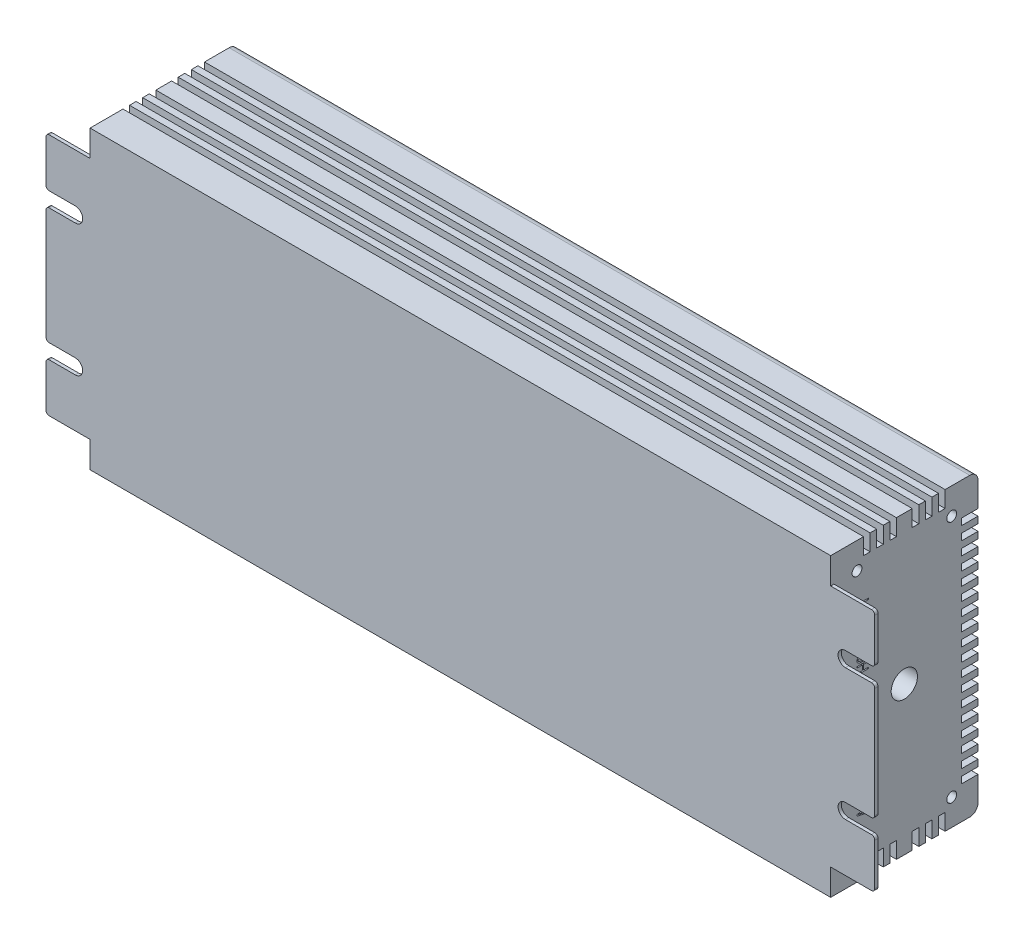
from build123d import *

# Parameters (mm, degrees)
ESQUISSE7_R             = 1.5
ESQUISSE7_R_2           = 4
BOSS_EXTRU_3_DEPTH      = 225.2
ESQUISSE1_R             = 5
BOSS_EXTRU_4_DEPTH      = 1
ESQUISSE8_W             = 0.40909091
ESQUISSE8_H             = 1.090909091
ESQUISSE8_W_2           = 0.5
ESQUISSE8_H_2           = 0.363636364
ENL_V_MAT_EXTRU_1_DEPTH = 1


with BuildPart() as part:
    # Esquisse7 → Boss.-Extru.3 (new body)
    with BuildSketch(Plane(origin=(112.599999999, 0, 0), x_dir=(0, 0, -1), z_dir=(1, 0, 0))):
        with BuildLine():
            Line((43.8, 42.5), (43.8, 35))
            Line((43.8, 35), (38.8, 35))
            Line((38.8, 35), (38.8, 33))
            Line((38.8, 33), (43.8, 33))
            Line((43.8, 33), (43.8, 31))
            Line((43.8, 31), (38.8, 31))
            Line((38.8, 31), (38.8, 29))
            Line((38.8, 29), (43.8, 29))
            Line((43.8, 29), (43.8, 27))
            Line((43.8, 27), (38.8, 27))
            Line((38.8, 27), (38.8, 25))
            Line((38.8, 25), (43.8, 25))
            Line((43.8, 25), (43.8, 23))
            Line((43.8, 23), (38.8, 23))
            Line((38.8, 23), (38.8, 21))
            Line((38.8, 21), (43.8, 21))
            Line((43.8, 21), (43.8, 19))
            Line((43.8, 19), (38.8, 19))
            Line((38.8, 19), (38.8, 17))
            Line((38.8, 17), (43.8, 17))
            Line((43.8, 17), (43.8, 15))
            Line((43.8, 15), (38.8, 15))
            Line((38.8, 15), (38.8, 13))
            Line((38.8, 13), (43.8, 13))
            Line((43.8, 13), (43.8, 11))
            Line((43.8, 11), (38.8, 11))
            Line((38.8, 11), (38.8, 9))
            Line((38.8, 9), (43.8, 9))
            Line((43.8, 9), (43.8, 7))
            Line((43.8, 7), (38.8, 7))
            Line((38.8, 7), (38.8, 5))
            Line((38.8, 5), (43.8, 5))
            Line((43.8, 5), (43.8, 3))
            Line((43.8, 3), (38.8, 3))
            Line((38.8, 3), (38.8, 1))
            Line((38.8, 1), (43.8, 1))
            Line((43.8, 1), (43.8, -1))
            Line((43.8, -1), (38.8, -1))
            Line((38.8, -1), (38.8, -3))
            Line((38.8, -3), (43.8, -3))
            Line((43.8, -3), (43.8, -5))
            Line((43.8, -5), (38.8, -5))
            Line((38.8, -5), (38.8, -7))
            Line((38.8, -7), (43.8, -7))
            Line((43.8, -7), (43.8, -9))
            Line((43.8, -9), (38.8, -9))
            Line((38.8, -9), (38.8, -11))
            Line((38.8, -11), (43.8, -11))
            Line((43.8, -11), (43.8, -13))
            Line((43.8, -13), (38.8, -13))
            Line((38.8, -13), (38.8, -15))
            Line((38.8, -15), (43.8, -15))
            Line((43.8, -15), (43.8, -17))
            Line((43.8, -17), (38.8, -17))
            Line((38.8, -17), (38.8, -19))
            Line((38.8, -19), (43.8, -19))
            Line((43.8, -19), (43.8, -21))
            Line((43.8, -21), (38.8, -21))
            Line((38.8, -21), (38.8, -23))
            Line((38.8, -23), (43.8, -23))
            Line((43.8, -23), (43.8, -25))
            Line((43.8, -25), (38.8, -25))
            Line((38.8, -25), (38.8, -27))
            Line((38.8, -27), (43.8, -27))
            Line((43.8, -27), (43.8, -29))
            Line((43.8, -29), (38.8, -29))
            Line((38.8, -29), (38.8, -31))
            Line((38.8, -31), (43.8, -31))
            Line((43.8, -31), (43.8, -33))
            Line((43.8, -33), (38.8, -33))
            Line((38.8, -33), (38.8, -35))
            Line((38.8, -35), (43.8, -35))
            Line((43.8, -35), (43.8, -42.5))
            ThreePointArc((43.8, -42.5), (43.067766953, -44.267766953), (41.3, -45))
            Line((41.3, -45), (33.8, -45))
            Line((33.8, -45), (33.8, -40))
            Line((33.8, -40), (31.8, -40))
            Line((31.8, -40), (31.8, -45))
            Line((31.8, -45), (29.8, -45))
            Line((29.8, -45), (29.8, -40))
            Line((29.8, -40), (27.8, -40))
            Line((27.8, -40), (27.8, -45))
            Line((27.8, -45), (25.8, -45))
            Line((25.8, -45), (25.8, -40))
            Line((25.8, -40), (23.8, -40))
            Line((23.8, -40), (23.8, -45))
            Line((23.8, -45), (19, -45))
            Line((19, -45), (19, -40))
            Line((19, -40), (17, -40))
            Line((17, -40), (17, -45))
            Line((17, -45), (15, -45))
            Line((15, -45), (15, -40))
            Line((15, -40), (13, -40))
            Line((13, -40), (13, -45))
            Line((13, -45), (11, -45))
            Line((11, -45), (11, -40))
            Line((11, -40), (9, -40))
            Line((9, -40), (9, -45))
            Line((9, -45), (-1, -45))
            Line((-1, -45), (-1, 45))
            Line((-1, 45), (9, 45))
            Line((9, 45), (9, 40))
            Line((9, 40), (11, 40))
            Line((11, 40), (11, 45))
            Line((11, 45), (13, 45))
            Line((13, 45), (13, 40))
            Line((13, 40), (15, 40))
            Line((15, 40), (15, 45))
            Line((15, 45), (17, 45))
            Line((17, 45), (17, 40))
            Line((17, 40), (19, 40))
            Line((19, 40), (19, 45))
            Line((19, 45), (23.8, 45))
            Line((23.8, 45), (23.8, 40))
            Line((23.8, 40), (25.8, 40))
            Line((25.8, 40), (25.8, 45))
            Line((25.8, 45), (27.8, 45))
            Line((27.8, 45), (27.8, 40))
            Line((27.8, 40), (29.8, 40))
            Line((29.8, 40), (29.8, 45))
            Line((29.8, 45), (31.8, 45))
            Line((31.8, 45), (31.8, 40))
            Line((31.8, 40), (33.8, 40))
            Line((33.8, 40), (33.8, 45))
            Line((33.8, 45), (41.3, 45))
            ThreePointArc((41.3, 45), (43.067766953, 44.267766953), (43.8, 42.5))
        make_face()
        with Locations((35.8, 37)):
            Circle(ESQUISSE7_R, mode=Mode.SUBTRACT)
        with Locations((21.4, 0)):
            Circle(ESQUISSE7_R_2, mode=Mode.SUBTRACT)
        with Locations((7, 37)):
            Circle(ESQUISSE7_R, mode=Mode.SUBTRACT)
        with Locations((7, -37)):
            Circle(ESQUISSE7_R, mode=Mode.SUBTRACT)
        with Locations((35.8, -37)):
            Circle(ESQUISSE7_R, mode=Mode.SUBTRACT)
    extrude(amount=-BOSS_EXTRU_3_DEPTH)

    # Esquisse1 → Boss.-Extru.4 (add)
    # profile 1 of 3: a face of its own
    with BuildSketch(Plane.XY):
        with BuildLine():
            Line((117.1, 17.75), (125, 17.75))
            ThreePointArc((125, 17.75), (125.707106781, 17.457106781), (126, 16.75))
            Line((126, 16.75), (126, -16.75))
            ThreePointArc((126, -16.75), (125.707106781, -17.457106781), (125, -17.75))
            Line((125, -17.75), (117.1, -17.75))
            ThreePointArc((117.1, -17.75), (114.85, -20), (117.1, -22.25))
            Line((117.1, -22.25), (125, -22.25))
            ThreePointArc((125, -22.25), (125.707106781, -22.542893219), (126, -23.25))
            Line((126, -23.25), (126, -36))
            ThreePointArc((126, -36), (125.707106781, -36.707106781), (125, -37))
            Line((125, -37), (112.599999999, -37))
            Line((112.599999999, -37), (112.599999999, 37))
            Line((112.599999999, 37), (125, 37))
            ThreePointArc((125, 37), (125.707106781, 36.707106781), (126, 36))
            Line((126, 36), (126, 23.25))
            ThreePointArc((126, 23.25), (125.707106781, 22.542893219), (125, 22.25))
            Line((125, 22.25), (117.1, 22.25))
            ThreePointArc((117.1, 22.25), (114.85, 20), (117.1, 17.75))
        make_face()
    # profile 2 of 3: a face of its own
    with BuildSketch(Plane.XY):
        Polygon((112.599999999, -37), (112.599999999, 37), (112.599999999, 45), (-112.599999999, 45), (-112.599999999, 37), (-112.599999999, -37), (-112.599999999, -45), (112.599999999, -45), align=None)
        Circle(ESQUISSE1_R, mode=Mode.SUBTRACT)
    # profile 3 of 3: a face of its own
    with BuildSketch(Plane.XY):
        with BuildLine():
            Line((-112.599999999, -37), (-112.599999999, 37))
            Line((-112.599999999, 37), (-125, 37))
            ThreePointArc((-125, 37), (-125.707106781, 36.707106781), (-126, 36))
            Line((-126, 36), (-126, 23.25))
            ThreePointArc((-126, 23.25), (-125.707106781, 22.542893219), (-125, 22.25))
            Line((-125, 22.25), (-117.1, 22.25))
            ThreePointArc((-117.1, 22.25), (-114.85, 20), (-117.1, 17.75))
            Line((-117.1, 17.75), (-125, 17.75))
            ThreePointArc((-125, 17.75), (-125.707106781, 17.457106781), (-126, 16.75))
            Line((-126, 16.75), (-126, -16.75))
            ThreePointArc((-126, -16.75), (-125.707106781, -17.457106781), (-125, -17.75))
            Line((-125, -17.75), (-117.1, -17.75))
            ThreePointArc((-117.1, -17.75), (-114.85, -20), (-117.1, -22.25))
            Line((-117.1, -22.25), (-125, -22.25))
            ThreePointArc((-125, -22.25), (-125.707106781, -22.542893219), (-126, -23.25))
            Line((-126, -23.25), (-126, -36))
            ThreePointArc((-126, -36), (-125.707106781, -36.707106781), (-125, -37))
            Line((-125, -37), (-112.599999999, -37))
        make_face()
    extrude(amount=BOSS_EXTRU_4_DEPTH)

    # Esquisse8 → Enl_v. mat.-Extru.1 (cut)
    # profile 1 of 22: a face of its own
    with BuildSketch(Plane(origin=(112.599999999, 0, 0), x_dir=(0, 0, -1), z_dir=(1, 0, 0))):
        Polygon((7, 28.068181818), (10.5, 28.068181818), (10.5, 27.704545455), (9.045454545, 27.704545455), (9.045454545, 26.204545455), (10.5, 26.204545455), (10.5, 25.840909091), (7, 25.840909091), (7, 26.204545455), (8.636363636, 26.204545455), (8.636363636, 27.704545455), (7, 27.704545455), align=None)
    # profile 2 of 22: a face of its own
    with BuildSketch(Plane(origin=(112.599999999, 0, 0), x_dir=(0, 0, -1), z_dir=(1, 0, 0))):
        Polygon((7, 25.159090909), (10.5, 25.159090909), (10.5, 24.795454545), (7.409090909, 24.795454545), (7.409090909, 23.340909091), (7, 23.340909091), align=None)
    # profile 3 of 22: a face of its own
    with BuildSketch(Plane(origin=(112.599999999, 0, 0), x_dir=(0, 0, -1), z_dir=(1, 0, 0))):
        with BuildLine():
            Line((8.363636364, 21.568181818), (8.772727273, 21.568181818))
            Line((8.772727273, 21.568181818), (8.772727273, 20.340909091))
            Line((8.772727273, 20.340909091), (7.490767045, 20.340909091))
            add(Edge.make_bspline(
                [(7.490767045, 20.340909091), (7.448300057, 20.387582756), (7.365185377, 20.478930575), (7.256615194, 20.624491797), (7.163606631, 20.771786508), (7.086781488, 20.92149823), (7.027466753, 21.074069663), (6.98546085, 21.22878943), (6.959568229, 21.385728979), (6.956223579, 21.491143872), (6.954545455, 21.544034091)],
                knots=[0, 0, 0, 0, 1.121120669, 2.194212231, 3.222848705, 4.214672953, 5.18059058, 6.1269216, 7.060213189, 8, 8, 8, 8], degree=3))
            add(Edge.make_bspline(
                [(6.954545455, 21.544034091), (6.955354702, 21.578850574), (6.956959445, 21.647891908), (6.965890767, 21.750014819), (6.982580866, 21.849369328), (7.005113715, 21.945759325), (7.034160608, 22.039450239), (7.070872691, 22.129526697), (7.112532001, 22.217499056), (7.161721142, 22.30188602), (7.217069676, 22.382797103), (7.278340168, 22.459675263), (7.345311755, 22.532513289), (7.418746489, 22.600809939), (7.498140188, 22.664504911), (7.583504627, 22.723754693), (7.674257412, 22.779375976), (7.771724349, 22.829572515), (7.874438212, 22.874798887), (7.982144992, 22.91509933), (8.095299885, 22.947920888), (8.213186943, 22.976202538), (8.336525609, 22.995931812), (8.464378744, 23.011993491), (8.597399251, 23.021284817), (8.687722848, 23.022240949), (8.733664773, 23.022727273)],
                knots=[0, 0, 0, 0, 0.963662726, 1.910950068, 2.834024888, 3.749394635, 4.648726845, 5.54538218, 6.43916054, 7.340399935, 8.245394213, 9.149914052, 10.058694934, 10.981188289, 11.922543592, 12.873110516, 13.855172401, 14.866137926, 15.904562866, 16.959718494, 18.046004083, 19.16320542, 20.31247099, 21.500559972, 22.728692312, 24, 24, 24, 24], degree=3))
            add(Edge.make_bspline(
                [(8.733664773, 23.022727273), (8.780318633, 23.022251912), (8.872064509, 23.021317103), (9.007419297, 23.011847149), (9.138003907, 22.996287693), (9.264078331, 22.974861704), (9.385965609, 22.948364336), (9.502927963, 22.913946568), (9.615421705, 22.874354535), (9.72269129, 22.828679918), (9.824611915, 22.778756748), (9.919838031, 22.723955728), (10.008185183, 22.665744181), (10.089695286, 22.603699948), (10.16428068, 22.53774353), (10.231987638, 22.467972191), (10.292903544, 22.394583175), (10.346063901, 22.316774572), (10.393208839, 22.235639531), (10.433614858, 22.150679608), (10.468591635, 22.062520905), (10.49723224, 21.970719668), (10.518165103, 21.875085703), (10.533720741, 21.775959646), (10.544236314, 21.673284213), (10.545045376, 21.603482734), (10.545454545, 21.568181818)],
                knots=[0, 0, 0, 0, 1.283103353, 2.523251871, 3.729970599, 4.899010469, 6.039703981, 7.158704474, 8.250293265, 9.318260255, 10.363755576, 11.370150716, 12.338210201, 13.272045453, 14.185427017, 15.074220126, 15.943841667, 16.805429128, 17.663218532, 18.522440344, 19.390671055, 20.270159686, 21.164351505, 22.080768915, 23.029381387, 24, 24, 24, 24], degree=3))
            add(Edge.make_bspline(
                [(10.545454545, 21.568181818), (10.544237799, 21.516722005), (10.54187083, 21.416615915), (10.519247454, 21.271288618), (10.48291004, 21.13560201), (10.430389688, 21.010357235), (10.365086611, 20.895560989), (10.286673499, 20.791618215), (10.196697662, 20.697677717), (10.110980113, 20.628991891), (10.036044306, 20.579184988), (9.97429222, 20.544183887), (9.907696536, 20.511570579), (9.835654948, 20.481936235), (9.758854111, 20.454284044), (9.677189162, 20.428619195), (9.590354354, 20.406023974), (9.530587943, 20.393019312), (9.5, 20.386363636)],
                knots=[0, 0, 0, 0, 1.421347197, 2.764983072, 4.053879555, 5.294541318, 6.507830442, 7.694739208, 8.88400819, 10.09388748, 10.721781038, 11.369410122, 12.054151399, 12.769859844, 13.521171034, 14.309628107, 15.134882, 16, 16, 16, 16], degree=3))
            Line((9.5, 20.386363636), (9.409090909, 20.75))
            add(Edge.make_bspline(
                [(9.409090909, 20.75), (9.453810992, 20.761846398), (9.53800399, 20.784149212), (9.65372282, 20.826175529), (9.752196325, 20.871589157), (9.834146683, 20.923770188), (9.902929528, 20.983364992), (9.96271805, 21.050133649), (10.014092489, 21.125904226), (10.058308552, 21.208770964), (10.092743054, 21.299318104), (10.118558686, 21.395358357), (10.133629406, 21.497156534), (10.135438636, 21.566711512), (10.136363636, 21.602272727)],
                knots=[0, 0, 0, 0, 1.35335294, 2.547912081, 3.598552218, 4.521073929, 5.380809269, 6.254255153, 7.136369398, 8.053803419, 8.996961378, 9.965011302, 10.959575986, 12, 12, 12, 12], degree=3))
            add(Edge.make_bspline(
                [(10.136363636, 21.602272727), (10.13601551, 21.628330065), (10.135330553, 21.679599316), (10.128104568, 21.755086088), (10.115850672, 21.827856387), (10.099701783, 21.897891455), (10.079171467, 21.965534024), (10.052850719, 22.029753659), (10.021924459, 22.091304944), (9.987275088, 22.150472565), (9.947336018, 22.206968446), (9.901642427, 22.260163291), (9.851043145, 22.310702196), (9.795378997, 22.358594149), (9.73414498, 22.403145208), (9.667929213, 22.445078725), (9.596578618, 22.484311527), (9.520145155, 22.520204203), (9.438985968, 22.553188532), (9.353220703, 22.581230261), (9.263167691, 22.605543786), (9.168838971, 22.625533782), (9.069840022, 22.639861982), (8.966625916, 22.651707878), (8.858976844, 22.657829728), (8.785754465, 22.658666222), (8.748579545, 22.659090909)],
                knots=[0, 0, 0, 0, 0.952661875, 1.874414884, 2.769644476, 3.649547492, 4.501185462, 5.351634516, 6.184046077, 7.018481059, 7.85681414, 8.710386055, 9.579662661, 10.469854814, 11.392786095, 12.346273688, 13.334311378, 14.368311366, 15.432566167, 16.535859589, 17.665700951, 18.842367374, 20.059394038, 21.322328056, 22.640548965, 24, 24, 24, 24], degree=3))
            add(Edge.make_bspline(
                [(8.748579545, 22.659090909), (8.692674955, 22.658151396), (8.584228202, 22.656328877), (8.426931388, 22.641883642), (8.280068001, 22.619072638), (8.144175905, 22.58572095), (8.018824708, 22.543388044), (7.904651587, 22.490586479), (7.800902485, 22.428959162), (7.708838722, 22.357357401), (7.627812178, 22.278341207), (7.557280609, 22.19349962), (7.496534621, 22.103532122), (7.448554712, 22.006701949), (7.409609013, 21.904860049), (7.382763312, 21.796842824), (7.367106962, 21.683226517), (7.364808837, 21.605636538), (7.363636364, 21.566051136)],
                knots=[0, 0, 0, 0, 1.344504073, 2.608141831, 3.796174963, 4.916279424, 5.969770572, 6.973627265, 7.936561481, 8.86602944, 9.772106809, 10.653603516, 11.515946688, 12.376727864, 13.247174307, 14.133861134, 15.047920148, 16, 16, 16, 16], degree=3))
            add(Edge.make_bspline(
                [(7.363636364, 21.566051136), (7.364863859, 21.527146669), (7.367356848, 21.448133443), (7.38817478, 21.329282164), (7.422011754, 21.209341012), (7.467638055, 21.090679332), (7.522183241, 20.97757876), (7.582178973, 20.873944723), (7.64811755, 20.782903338), (7.69760866, 20.730122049), (7.721590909, 20.704545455)],
                knots=[0, 0, 0, 0, 0.978162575, 1.986604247, 3.025534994, 4.109442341, 5.180230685, 6.181206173, 7.118654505, 8, 8, 8, 8], degree=3))
            Line((7.721590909, 20.704545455), (8.363636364, 20.704545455))
            Line((8.363636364, 20.704545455), (8.363636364, 21.568181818))
        make_face()
    # profile 4 of 22: a face of its own
    with BuildSketch(Plane(origin=(112.599999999, 0, 0), x_dir=(0, 0, -1), z_dir=(1, 0, 0))):
        with Locations((8.25, 19.431818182)):
            Rectangle(ESQUISSE8_W, ESQUISSE8_H)
    # profile 5 of 22: a face of its own
    with BuildSketch(Plane(origin=(112.599999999, 0, 0), x_dir=(0, 0, -1), z_dir=(1, 0, 0))):
        with BuildLine():
            Line((7.954545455, 18.568181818), (8, 18.204545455))
            add(Edge.make_bspline(
                [(8, 18.204545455), (7.972482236, 18.199855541), (7.918860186, 18.190716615), (7.841695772, 18.17273526), (7.769489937, 18.153110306), (7.702922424, 18.13036455), (7.641343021, 18.105571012), (7.585144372, 18.07807665), (7.534335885, 18.047336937), (7.48888811, 18.014108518), (7.448585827, 17.978288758), (7.413693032, 17.9400406), (7.384234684, 17.899005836), (7.359719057, 17.855575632), (7.341532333, 17.809062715), (7.327652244, 17.760380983), (7.319932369, 17.708815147), (7.318773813, 17.673556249), (7.318181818, 17.655539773)],
                knots=[0, 0, 0, 0, 1.392235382, 2.712957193, 3.95076201, 5.123471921, 6.220028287, 7.260520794, 8.240826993, 9.178593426, 10.065213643, 10.926376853, 11.755607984, 12.580369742, 13.407158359, 14.241002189, 15.101193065, 16, 16, 16, 16], degree=3))
            add(Edge.make_bspline(
                [(7.318181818, 17.655539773), (7.318555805, 17.635833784), (7.319290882, 17.597101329), (7.330283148, 17.540351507), (7.345219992, 17.485176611), (7.368843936, 17.432527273), (7.396813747, 17.38113575), (7.432404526, 17.3322446), (7.474409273, 17.285775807), (7.521529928, 17.24109715), (7.574155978, 17.200714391), (7.630923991, 17.165123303), (7.691941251, 17.135173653), (7.756343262, 17.110422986), (7.824534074, 17.091016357), (7.896345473, 17.077724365), (7.972126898, 17.069891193), (8.023892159, 17.06876109), (8.050426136, 17.068181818)],
                knots=[0, 0, 0, 0, 0.903873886, 1.776579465, 2.647656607, 3.524622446, 4.420541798, 5.332235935, 6.29517969, 7.295547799, 8.311582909, 9.337756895, 10.369048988, 11.429583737, 12.503863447, 13.621753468, 14.780951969, 16, 16, 16, 16], degree=3))
            add(Edge.make_bspline(
                [(8.050426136, 17.068181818), (8.075298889, 17.068825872), (8.123725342, 17.070079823), (8.194559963, 17.076976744), (8.261668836, 17.089613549), (8.32486862, 17.108494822), (8.385132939, 17.130853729), (8.441230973, 17.15939325), (8.493485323, 17.193070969), (8.541519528, 17.231174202), (8.584825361, 17.273233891), (8.623315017, 17.317620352), (8.655616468, 17.365093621), (8.68196522, 17.414597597), (8.7019063, 17.466716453), (8.717114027, 17.520578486), (8.725678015, 17.577377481), (8.726734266, 17.615976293), (8.727272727, 17.635653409)],
                knots=[0, 0, 0, 0, 1.20855087, 2.353009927, 3.453810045, 4.520244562, 5.554115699, 6.572581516, 7.571175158, 8.569901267, 9.54598548, 10.500346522, 11.419112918, 12.329780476, 13.2183167, 14.125199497, 15.044253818, 16, 16, 16, 16], degree=3))
            add(Edge.make_bspline(
                [(8.727272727, 17.635653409), (8.726712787, 17.65344544), (8.72551915, 17.691373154), (8.715196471, 17.751095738), (8.700688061, 17.817190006), (8.686451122, 17.862550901), (8.678977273, 17.886363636)],
                knots=[0, 0, 0, 0, 0.832645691, 1.774971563, 2.831945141, 4, 4, 4, 4], degree=3))
            Line((8.678977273, 17.886363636), (9.090909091, 17.840909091))
            Line((9.090909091, 17.840909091), (9.0859375, 17.786221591))
            add(Edge.make_bspline(
                [(9.0859375, 17.786221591), (9.086175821, 17.765117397), (9.086640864, 17.723935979), (9.095285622, 17.663715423), (9.106668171, 17.606239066), (9.124272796, 17.552021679), (9.144970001, 17.500310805), (9.17290493, 17.452688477), (9.203673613, 17.406922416), (9.240057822, 17.365123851), (9.28046035, 17.327412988), (9.324665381, 17.294745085), (9.371778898, 17.266880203), (9.421963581, 17.243891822), (9.475569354, 17.226207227), (9.532383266, 17.213316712), (9.592636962, 17.206461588), (9.633743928, 17.205195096), (9.654829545, 17.204545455)],
                knots=[0, 0, 0, 0, 1.10423394, 2.154733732, 3.181022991, 4.16930239, 5.136508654, 6.091636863, 7.054700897, 8.021748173, 8.986885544, 9.944184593, 10.894794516, 11.849198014, 12.829510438, 13.846317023, 14.895278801, 16, 16, 16, 16], degree=3))
            add(Edge.make_bspline(
                [(9.654829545, 17.204545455), (9.692599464, 17.206175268), (9.765186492, 17.209307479), (9.868571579, 17.233350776), (9.960083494, 17.275247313), (10.038323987, 17.332923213), (10.101373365, 17.402328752), (10.148622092, 17.47986296), (10.176617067, 17.565850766), (10.180063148, 17.625746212), (10.181818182, 17.65625)],
                knots=[0, 0, 0, 0, 1.168747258, 2.246123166, 3.262822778, 4.26410748, 5.234436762, 6.148309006, 7.056963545, 8, 8, 8, 8], degree=3))
            add(Edge.make_bspline(
                [(10.181818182, 17.65625), (10.180304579, 17.687932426), (10.17734923, 17.749793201), (10.150469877, 17.838160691), (10.107977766, 17.91899478), (10.057861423, 17.978041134), (10.010122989, 18.019910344), (9.969960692, 18.049558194), (9.925021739, 18.075557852), (9.875977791, 18.099107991), (9.822278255, 18.119175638), (9.764034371, 18.134703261), (9.70194433, 18.149728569), (9.65868664, 18.155904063), (9.636363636, 18.159090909)],
                knots=[0, 0, 0, 0, 1.389005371, 2.712069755, 4.019587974, 5.377996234, 6.085444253, 6.807349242, 7.567292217, 8.362846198, 9.195542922, 10.081373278, 11.009898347, 12, 12, 12, 12], degree=3))
            Line((9.636363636, 18.159090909), (9.681818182, 18.522727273))
            add(Edge.make_bspline(
                [(9.681818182, 18.522727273), (9.71646135, 18.51674447), (9.784039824, 18.505073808), (9.881514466, 18.48118368), (9.971894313, 18.450916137), (10.056327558, 18.417218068), (10.134183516, 18.377405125), (10.20505345, 18.331612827), (10.270603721, 18.282227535), (10.327710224, 18.226251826), (10.379361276, 18.167504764), (10.423269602, 18.104540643), (10.461337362, 18.039186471), (10.491959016, 17.97028222), (10.516252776, 17.898535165), (10.533250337, 17.823569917), (10.543299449, 17.745776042), (10.544729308, 17.692974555), (10.545454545, 17.666193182)],
                knots=[0, 0, 0, 0, 1.259944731, 2.457775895, 3.592886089, 4.673894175, 5.713785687, 6.721284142, 7.69553461, 8.649770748, 9.582174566, 10.495658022, 11.396640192, 12.289271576, 13.19360432, 14.107600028, 15.040158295, 16, 16, 16, 16], degree=3))
            add(Edge.make_bspline(
                [(10.545454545, 17.666193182), (10.544622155, 17.637974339), (10.542984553, 17.582458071), (10.530419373, 17.500860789), (10.510834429, 17.422386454), (10.482280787, 17.347243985), (10.444668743, 17.276101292), (10.40056378, 17.20720598), (10.347720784, 17.141719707), (10.287003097, 17.080668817), (10.220560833, 17.024629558), (10.149172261, 16.975477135), (10.07404258, 16.933259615), (9.994083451, 16.899735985), (9.910102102, 16.873532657), (9.821961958, 16.854384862), (9.729484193, 16.842659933), (9.666465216, 16.841501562), (9.634232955, 16.840909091)],
                knots=[0, 0, 0, 0, 0.987546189, 1.94284647, 2.883618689, 3.814886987, 4.749064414, 5.696240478, 6.674807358, 7.688712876, 8.706405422, 9.713376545, 10.718845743, 11.717906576, 12.742863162, 13.794678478, 14.872046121, 16, 16, 16, 16], degree=3))
            add(Edge.make_bspline(
                [(9.634232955, 16.840909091), (9.59530769, 16.841982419), (9.519287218, 16.844078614), (9.409186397, 16.864949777), (9.305502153, 16.896554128), (9.209457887, 16.942232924), (9.12195049, 16.999894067), (9.043922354, 17.068000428), (8.975012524, 17.145926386), (8.938785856, 17.205128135), (8.920454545, 17.235085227)],
                knots=[0, 0, 0, 0, 1.089886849, 2.128533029, 3.129639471, 4.121022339, 5.098291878, 6.057736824, 7.017181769, 8, 8, 8, 8], degree=3))
            add(Edge.make_bspline(
                [(8.920454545, 17.235085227), (8.911986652, 17.207564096), (8.895441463, 17.153791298), (8.858181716, 17.079609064), (8.814914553, 17.011962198), (8.763006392, 16.95153796), (8.702490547, 16.897722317), (8.63265365, 16.849900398), (8.553719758, 16.807634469), (8.466346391, 16.770682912), (8.371702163, 16.741117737), (8.270885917, 16.719894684), (8.164642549, 16.706847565), (8.091894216, 16.705324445), (8.0546875, 16.704545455)],
                knots=[0, 0, 0, 0, 0.945030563, 1.846469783, 2.718540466, 3.579533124, 4.455899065, 5.373354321, 6.355314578, 7.394566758, 8.487420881, 9.609289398, 10.777284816, 12, 12, 12, 12], degree=3))
            add(Edge.make_bspline(
                [(8.0546875, 16.704545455), (8.015106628, 16.705241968), (7.937832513, 16.706601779), (7.824572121, 16.720822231), (7.716846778, 16.742343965), (7.614271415, 16.773044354), (7.517639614, 16.812716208), (7.426398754, 16.861708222), (7.340539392, 16.918987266), (7.261265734, 16.984934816), (7.190288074, 17.057044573), (7.126860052, 17.132607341), (7.073649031, 17.212193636), (7.029689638, 17.295125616), (6.996308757, 17.381774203), (6.971912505, 17.471675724), (6.957503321, 17.565350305), (6.955540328, 17.628975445), (6.954545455, 17.661221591)],
                knots=[0, 0, 0, 0, 1.16797173, 2.280242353, 3.364490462, 4.408173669, 5.436152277, 6.443028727, 7.460738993, 8.478233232, 9.481512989, 10.444418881, 11.386528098, 12.302557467, 13.209825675, 14.12198051, 15.04819242, 16, 16, 16, 16], degree=3))
            add(Edge.make_bspline(
                [(6.954545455, 17.661221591), (6.955334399, 17.691099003), (6.95688845, 17.749951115), (6.970087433, 17.836356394), (6.991270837, 17.919266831), (7.021483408, 17.998370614), (7.059264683, 18.074591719), (7.106307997, 18.146748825), (7.161723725, 18.215740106), (7.225133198, 18.280567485), (7.296114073, 18.339807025), (7.372638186, 18.393613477), (7.455109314, 18.440874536), (7.544334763, 18.479345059), (7.638529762, 18.512266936), (7.738445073, 18.538596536), (7.844361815, 18.55790515), (7.917307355, 18.564708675), (7.954545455, 18.568181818)],
                knots=[0, 0, 0, 0, 0.959274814, 1.889566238, 2.800731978, 3.703256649, 4.604498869, 5.528396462, 6.464265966, 7.442996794, 8.436156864, 9.429840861, 10.444772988, 11.483305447, 12.546329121, 13.647537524, 14.799087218, 16, 16, 16, 16], degree=3))
        make_face()
    # profile 6 of 22: a face of its own
    with BuildSketch(Plane(origin=(112.599999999, 0, 0), x_dir=(0, 0, -1), z_dir=(1, 0, 0))):
        with BuildLine():
            Line((7.409090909, 14.477272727), (7, 14.477272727))
            Line((7, 14.477272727), (7, 16.340909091))
            add(Edge.make_bspline(
                [(7, 16.340909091), (7.021315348, 16.340995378), (7.064500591, 16.341170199), (7.130340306, 16.335357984), (7.197774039, 16.323416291), (7.267701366, 16.308167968), (7.339202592, 16.286547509), (7.412625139, 16.260080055), (7.487786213, 16.228850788), (7.565130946, 16.192284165), (7.645401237, 16.149554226), (7.728261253, 16.097991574), (7.815197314, 16.0387333), (7.905679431, 15.971701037), (7.998849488, 15.895583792), (8.096090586, 15.812640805), (8.197200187, 15.721688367), (8.264398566, 15.656930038), (8.299005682, 15.623579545)],
                knots=[0, 0, 0, 0, 0.672188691, 1.361865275, 2.08134618, 2.831455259, 3.618325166, 4.435686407, 5.292818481, 6.184803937, 7.133719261, 8.159707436, 9.261705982, 10.452168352, 11.710682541, 13.056179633, 14.483934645, 16, 16, 16, 16], degree=3))
            add(Edge.make_bspline(
                [(8.299005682, 15.623579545), (8.339091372, 15.58482022), (8.416273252, 15.510192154), (8.530266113, 15.405197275), (8.636118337, 15.309667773), (8.736306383, 15.225988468), (8.827797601, 15.150994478), (8.913539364, 15.087516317), (8.99183102, 15.034183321), (9.085140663, 14.977998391), (9.19558332, 14.923812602), (9.324970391, 14.87740342), (9.449540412, 14.846426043), (9.531795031, 14.842712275), (9.571732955, 14.840909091)],
                knots=[0, 0, 0, 0, 1.312411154, 2.526945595, 3.64776648, 4.668054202, 5.599250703, 6.431783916, 7.178281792, 7.828133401, 8.994463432, 10.06613924, 11.061032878, 12, 12, 12, 12], degree=3))
            add(Edge.make_bspline(
                [(9.571732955, 14.840909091), (9.593781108, 14.841154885), (9.636843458, 14.841634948), (9.699689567, 14.850162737), (9.759689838, 14.861786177), (9.816387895, 14.879053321), (9.870476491, 14.900164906), (9.920645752, 14.927410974), (9.968089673, 14.9588588), (10.011813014, 14.994879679), (10.051268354, 15.034567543), (10.086711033, 15.076401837), (10.115397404, 15.121460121), (10.140369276, 15.167893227), (10.158467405, 15.217269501), (10.172262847, 15.268549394), (10.180041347, 15.322207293), (10.181220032, 15.358641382), (10.181818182, 15.377130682)],
                knots=[0, 0, 0, 0, 1.164573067, 2.274533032, 3.347172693, 4.392521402, 5.403514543, 6.411404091, 7.404182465, 8.408958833, 9.400158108, 10.360045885, 11.300813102, 12.21891196, 13.141775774, 14.073760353, 15.022486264, 16, 16, 16, 16], degree=3))
            add(Edge.make_bspline(
                [(10.181818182, 15.377130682), (10.181398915, 15.397065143), (10.180580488, 15.435978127), (10.170449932, 15.492706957), (10.156823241, 15.547022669), (10.136051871, 15.598650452), (10.10837732, 15.646881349), (10.076896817, 15.693683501), (10.037573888, 15.736215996), (9.993775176, 15.776842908), (9.944451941, 15.813636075), (9.889445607, 15.845112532), (9.829611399, 15.872275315), (9.764297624, 15.893886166), (9.694024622, 15.911196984), (9.618658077, 15.922662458), (9.538305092, 15.931103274), (9.482978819, 15.931575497), (9.454545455, 15.931818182)],
                knots=[0, 0, 0, 0, 0.928984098, 1.813419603, 2.681561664, 3.539025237, 4.399543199, 5.272870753, 6.164589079, 7.094951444, 8.058244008, 9.028353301, 10.046819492, 11.119271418, 12.233850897, 13.41977698, 14.673967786, 16, 16, 16, 16], degree=3))
            Line((9.454545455, 15.931818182), (9.5, 16.295454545))
            add(Edge.make_bspline(
                [(9.5, 16.295454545), (9.542197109, 16.291707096), (9.624061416, 16.284436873), (9.742572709, 16.265361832), (9.852529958, 16.238891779), (9.95503012, 16.207470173), (10.048801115, 16.167938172), (10.135549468, 16.123740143), (10.213389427, 16.071354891), (10.283283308, 16.012936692), (10.345293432, 15.948974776), (10.398819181, 15.879829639), (10.443940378, 15.805595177), (10.481880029, 15.727119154), (10.510211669, 15.64277943), (10.530774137, 15.554089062), (10.542956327, 15.460326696), (10.544609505, 15.39634255), (10.545454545, 15.363636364)],
                knots=[0, 0, 0, 0, 1.296155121, 2.514599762, 3.669097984, 4.755193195, 5.79120272, 6.77953026, 7.729955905, 8.65570694, 9.562583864, 10.450894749, 11.325630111, 12.216772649, 13.112585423, 14.04224033, 14.999270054, 16, 16, 16, 16], degree=3))
            add(Edge.make_bspline(
                [(10.545454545, 15.363636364), (10.544417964, 15.328323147), (10.542399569, 15.259562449), (10.529099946, 15.159463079), (10.505640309, 15.066102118), (10.47299586, 14.979062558), (10.430020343, 14.899389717), (10.378470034, 14.825787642), (10.31677786, 14.759484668), (10.246580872, 14.700481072), (10.170794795, 14.648336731), (10.091548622, 14.602837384), (10.010155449, 14.563370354), (9.925709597, 14.532525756), (9.839344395, 14.506767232), (9.749750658, 14.490585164), (9.657962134, 14.479193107), (9.595916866, 14.477916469), (9.564630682, 14.477272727)],
                knots=[0, 0, 0, 0, 1.141256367, 2.222215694, 3.255808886, 4.246221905, 5.218350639, 6.173592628, 7.142736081, 8.136099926, 9.131465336, 10.11177911, 11.087094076, 12.050634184, 13.014356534, 13.995714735, 14.989343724, 16, 16, 16, 16], degree=3))
            add(Edge.make_bspline(
                [(9.564630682, 14.477272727), (9.536442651, 14.477877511), (9.480433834, 14.479079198), (9.396875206, 14.486944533), (9.31440133, 14.500685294), (9.232471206, 14.519006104), (9.151510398, 14.543113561), (9.071770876, 14.573306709), (8.992830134, 14.608176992), (8.913180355, 14.648571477), (8.831052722, 14.697212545), (8.743748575, 14.755011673), (8.650271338, 14.822442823), (8.550744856, 14.900006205), (8.443438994, 14.985279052), (8.330638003, 15.081670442), (8.211441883, 15.187432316), (8.130559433, 15.261938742), (8.088778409, 15.300426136)],
                knots=[0, 0, 0, 0, 0.780477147, 1.55078595, 2.321289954, 3.094132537, 3.873921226, 4.65799601, 5.453333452, 6.262435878, 7.129199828, 8.094578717, 9.160616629, 10.319634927, 11.58800954, 12.955242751, 14.427185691, 16, 16, 16, 16], degree=3))
            add(Edge.make_bspline(
                [(8.088778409, 15.300426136), (8.062782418, 15.324859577), (8.013101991, 15.371553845), (7.941213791, 15.437678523), (7.87581799, 15.497016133), (7.817835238, 15.550858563), (7.765315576, 15.596543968), (7.719646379, 15.636152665), (7.680264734, 15.668516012), (7.618354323, 15.71701851), (7.531123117, 15.778192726), (7.448886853, 15.820456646), (7.409090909, 15.840909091)],
                knots=[0, 0, 0, 0, 1.227496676, 2.345844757, 3.360613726, 4.265798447, 5.068085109, 5.75545707, 6.345771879, 6.821573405, 8.46188917, 10, 10, 10, 10], degree=3))
            Line((7.409090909, 15.840909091), (7.409090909, 14.477272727))
        make_face()
    # profile 7 of 22: a face of its own
    with BuildSketch(Plane(origin=(112.599999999, 0, 0), x_dir=(0, 0, -1), z_dir=(1, 0, 0))):
        with BuildLine():
            add(Edge.make_bspline(
                [(8.748579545, 14.113636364), (8.820092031, 14.113058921), (8.958952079, 14.111937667), (9.160352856, 14.100349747), (9.348505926, 14.082072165), (9.523158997, 14.057217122), (9.68433829, 14.023578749), (9.832302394, 13.983966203), (9.966580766, 13.935314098), (10.087749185, 13.880553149), (10.195131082, 13.817754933), (10.289095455, 13.748522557), (10.368117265, 13.670802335), (10.433826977, 13.586737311), (10.483886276, 13.494655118), (10.519862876, 13.395866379), (10.541572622, 13.290005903), (10.544143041, 13.21695847), (10.545454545, 13.1796875)],
                knots=[0, 0, 0, 0, 1.522295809, 2.955932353, 4.292935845, 5.545987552, 6.709403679, 7.796379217, 8.803980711, 9.746667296, 10.623167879, 11.447716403, 12.224665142, 12.975696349, 13.710987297, 14.4460191, 15.207112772, 16, 16, 16, 16], degree=3))
            add(Edge.make_bspline(
                [(10.545454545, 13.1796875), (10.544389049, 13.146473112), (10.542296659, 13.081247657), (10.525041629, 12.986067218), (10.495686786, 12.896543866), (10.454892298, 12.81260998), (10.402222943, 12.73452052), (10.33853912, 12.661507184), (10.26255683, 12.59437008), (10.205476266, 12.555494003), (10.176136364, 12.535511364)],
                knots=[0, 0, 0, 0, 1.02435884, 2.0116063, 2.972586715, 3.92329494, 4.881606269, 5.870473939, 6.905405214, 8, 8, 8, 8], degree=3))
            add(Edge.make_bspline(
                [(10.176136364, 12.535511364), (10.136580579, 12.512376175), (10.054320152, 12.464264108), (9.916473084, 12.406907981), (9.762658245, 12.358165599), (9.591802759, 12.318801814), (9.404594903, 12.288137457), (9.200741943, 12.265551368), (8.980297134, 12.252077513), (8.82767119, 12.250709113), (8.748579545, 12.25)],
                knots=[0, 0, 0, 0, 0.745771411, 1.550910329, 2.425371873, 3.372025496, 4.40417091, 5.51399708, 6.711738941, 8, 8, 8, 8], degree=3))
            add(Edge.make_bspline(
                [(8.748579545, 12.25), (8.677539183, 12.250568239), (8.53962277, 12.251671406), (8.339187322, 12.263405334), (8.151927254, 12.281335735), (7.977925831, 12.306870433), (7.8169464, 12.339006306), (7.669126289, 12.379418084), (7.53411795, 12.426487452), (7.412924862, 12.482007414), (7.30496675, 12.54392982), (7.211650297, 12.614259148), (7.131709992, 12.690855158), (7.067161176, 12.775976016), (7.015727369, 12.867473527), (6.980345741, 12.966916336), (6.95833483, 13.07313289), (6.955828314, 13.146433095), (6.954545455, 13.183948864)],
                knots=[0, 0, 0, 0, 1.513638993, 2.938550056, 4.276810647, 5.521058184, 6.684551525, 7.772549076, 8.784146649, 9.727719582, 10.609399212, 11.430689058, 12.211976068, 12.960643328, 13.699059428, 14.439523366, 15.201332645, 16, 16, 16, 16], degree=3))
            add(Edge.make_bspline(
                [(6.954545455, 13.183948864), (6.955812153, 13.217406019), (6.958302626, 13.283186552), (6.976880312, 13.379556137), (7.009775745, 13.470692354), (7.053640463, 13.557653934), (7.110811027, 13.63981049), (7.180944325, 13.716421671), (7.263625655, 13.788404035), (7.358706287, 13.856771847), (7.470051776, 13.918130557), (7.599129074, 13.971352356), (7.746538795, 14.015350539), (7.911896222, 14.051013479), (8.095242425, 14.079136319), (8.296731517, 14.099359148), (8.516665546, 14.111234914), (8.669255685, 14.112814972), (8.748579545, 14.113636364)],
                knots=[0, 0, 0, 0, 0.713869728, 1.403548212, 2.084322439, 2.775775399, 3.476561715, 4.213413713, 4.986745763, 5.812567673, 6.708194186, 7.693455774, 8.786715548, 9.986913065, 11.301071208, 12.743477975, 14.307099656, 16, 16, 16, 16], degree=3))
        make_face()
        with BuildLine():
            add(Edge.make_bspline(
                [(8.75, 13.75), (8.681813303, 13.74936593), (8.551556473, 13.748154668), (8.364636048, 13.741498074), (8.195472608, 13.728916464), (8.043533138, 13.711441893), (7.909445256, 13.689287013), (7.792470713, 13.661942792), (7.693085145, 13.629359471), (7.609873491, 13.591025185), (7.540797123, 13.548515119), (7.481935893, 13.503108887), (7.430887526, 13.45616026), (7.390110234, 13.404839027), (7.357138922, 13.351557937), (7.335625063, 13.294258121), (7.320096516, 13.23496076), (7.318824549, 13.19399543), (7.318181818, 13.173295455)],
                knots=[0, 0, 0, 0, 1.930873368, 3.688541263, 5.295281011, 6.732986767, 8.018032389, 9.141589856, 10.131594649, 10.974379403, 11.729767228, 12.422984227, 13.077418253, 13.687793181, 14.274134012, 14.843047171, 15.415386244, 16, 16, 16, 16], degree=3))
            add(Edge.make_bspline(
                [(7.318181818, 13.173295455), (7.318852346, 13.15378035), (7.320187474, 13.11492267), (7.335607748, 13.058320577), (7.357883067, 13.003777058), (7.391213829, 12.952631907), (7.432409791, 12.903418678), (7.483716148, 12.857223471), (7.543644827, 12.813222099), (7.613777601, 12.771097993), (7.697403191, 12.733150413), (7.797274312, 12.700963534), (7.914121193, 12.673499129), (8.048359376, 12.652521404), (8.199482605, 12.634659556), (8.367715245, 12.622133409), (8.553212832, 12.615498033), (8.682523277, 12.614274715), (8.75, 12.613636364)],
                knots=[0, 0, 0, 0, 0.556129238, 1.107341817, 1.665113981, 2.233690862, 2.843387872, 3.494489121, 4.200669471, 4.965119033, 5.82775868, 6.818098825, 7.958326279, 9.253800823, 10.697700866, 12.3053812, 14.072075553, 16, 16, 16, 16], degree=3))
            add(Edge.make_bspline(
                [(8.75, 12.613636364), (8.818185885, 12.61428343), (8.948914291, 12.615524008), (9.136081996, 12.622037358), (9.305695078, 12.634847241), (9.457445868, 12.652012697), (9.591680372, 12.674592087), (9.708572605, 12.701395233), (9.807760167, 12.734509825), (9.890799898, 12.772304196), (9.959280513, 12.815665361), (10.018972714, 12.859999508), (10.06910251, 12.908501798), (10.10980057, 12.960066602), (10.142794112, 13.01383675), (10.165609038, 13.071467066), (10.179550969, 13.132144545), (10.18105927, 13.173695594), (10.181818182, 13.194602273)],
                knots=[0, 0, 0, 0, 1.926235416, 3.693047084, 5.289258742, 6.730153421, 8.005519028, 9.13288288, 10.114172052, 10.95493244, 11.702816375, 12.399683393, 13.05233992, 13.666478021, 14.251410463, 14.827637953, 15.41011848, 16, 16, 16, 16], degree=3))
            add(Edge.make_bspline(
                [(10.181818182, 13.194602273), (10.181150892, 13.2141131), (10.179830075, 13.252732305), (10.164616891, 13.308761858), (10.141464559, 13.362350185), (10.109331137, 13.413961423), (10.066713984, 13.46206203), (10.015626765, 13.507915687), (9.955413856, 13.551065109), (9.885681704, 13.593055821), (9.802378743, 13.63167591), (9.702037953, 13.662296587), (9.585354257, 13.689922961), (9.451543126, 13.712366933), (9.300443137, 13.728593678), (9.132299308, 13.741621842), (8.946782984, 13.748104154), (8.817475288, 13.74934993), (8.75, 13.75)],
                knots=[0, 0, 0, 0, 0.557198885, 1.102904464, 1.649282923, 2.224688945, 2.83480633, 3.482602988, 4.186138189, 4.952058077, 5.810197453, 6.806783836, 7.949204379, 9.241603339, 10.687502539, 12.29827505, 14.068367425, 16, 16, 16, 16], degree=3))
        make_face(mode=Mode.SUBTRACT)
    # profile 8 of 22: a face of its own
    with BuildSketch(Plane(origin=(112.599999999, 0, 0), x_dir=(0, 0, -1), z_dir=(1, 0, 0))):
        Polygon((7, 11.75), (10.5, 11.75), (10.5, 11.386363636), (9.045454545, 11.386363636), (9.045454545, 9.886363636), (10.5, 9.886363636), (10.5, 9.522727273), (7, 9.522727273), (7, 9.886363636), (8.636363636, 9.886363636), (8.636363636, 11.386363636), (7, 11.386363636), align=None)
    # profile 9 of 22: a face of its own
    with BuildSketch(Plane(origin=(112.599999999, 0, 0), x_dir=(0, 0, -1), z_dir=(1, 0, 0))):
        with Locations((8.25, 7.340909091)):
            Rectangle(ESQUISSE8_W, ESQUISSE8_H)
    # profile 10 of 22: a face of its own
    with BuildSketch(Plane(origin=(112.599999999, 0, 0), x_dir=(0, 0, -1), z_dir=(1, 0, 0))):
        with BuildLine():
            Line((7.954545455, 5.340909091), (8, 4.977272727))
            add(Edge.make_bspline(
                [(8, 4.977272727), (7.972482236, 4.972582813), (7.918860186, 4.963443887), (7.841695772, 4.945462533), (7.769489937, 4.925837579), (7.702922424, 4.903091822), (7.641343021, 4.878298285), (7.585144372, 4.850803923), (7.534335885, 4.82006421), (7.48888811, 4.78683579), (7.448585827, 4.75101603), (7.413693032, 4.712767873), (7.384234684, 4.671733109), (7.359719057, 4.628302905), (7.341532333, 4.581789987), (7.327652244, 4.533108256), (7.319932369, 4.48154242), (7.318773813, 4.446283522), (7.318181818, 4.428267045)],
                knots=[0, 0, 0, 0, 1.392235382, 2.712957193, 3.95076201, 5.123471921, 6.220028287, 7.260520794, 8.240826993, 9.178593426, 10.065213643, 10.926376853, 11.755607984, 12.580369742, 13.407158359, 14.241002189, 15.101193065, 16, 16, 16, 16], degree=3))
            add(Edge.make_bspline(
                [(7.318181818, 4.428267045), (7.318555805, 4.408561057), (7.319290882, 4.369828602), (7.330283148, 4.31307878), (7.345219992, 4.257903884), (7.368843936, 4.205254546), (7.396813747, 4.153863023), (7.432404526, 4.104971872), (7.474409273, 4.05850308), (7.521529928, 4.013824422), (7.574155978, 3.973441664), (7.630923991, 3.937850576), (7.691941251, 3.907900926), (7.756343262, 3.883150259), (7.824534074, 3.86374363), (7.896345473, 3.850451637), (7.972126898, 3.842618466), (8.023892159, 3.841488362), (8.050426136, 3.840909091)],
                knots=[0, 0, 0, 0, 0.903873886, 1.776579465, 2.647656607, 3.524622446, 4.420541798, 5.332235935, 6.29517969, 7.295547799, 8.311582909, 9.337756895, 10.369048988, 11.429583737, 12.503863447, 13.621753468, 14.780951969, 16, 16, 16, 16], degree=3))
            add(Edge.make_bspline(
                [(8.050426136, 3.840909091), (8.075298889, 3.841553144), (8.123725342, 3.842807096), (8.194559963, 3.849704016), (8.261668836, 3.862340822), (8.32486862, 3.881222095), (8.385132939, 3.903581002), (8.441230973, 3.932120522), (8.493485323, 3.965798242), (8.541519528, 4.003901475), (8.584825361, 4.045961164), (8.623315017, 4.090347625), (8.655616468, 4.137820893), (8.68196522, 4.18732487), (8.7019063, 4.239443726), (8.717114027, 4.293305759), (8.725678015, 4.350104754), (8.726734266, 4.388703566), (8.727272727, 4.408380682)],
                knots=[0, 0, 0, 0, 1.20855087, 2.353009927, 3.453810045, 4.520244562, 5.554115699, 6.572581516, 7.571175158, 8.569901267, 9.54598548, 10.500346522, 11.419112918, 12.329780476, 13.2183167, 14.125199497, 15.044253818, 16, 16, 16, 16], degree=3))
            add(Edge.make_bspline(
                [(8.727272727, 4.408380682), (8.726712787, 4.426172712), (8.72551915, 4.464100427), (8.715196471, 4.523823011), (8.700688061, 4.589917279), (8.686451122, 4.635278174), (8.678977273, 4.659090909)],
                knots=[0, 0, 0, 0, 0.832645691, 1.774971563, 2.831945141, 4, 4, 4, 4], degree=3))
            Line((8.678977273, 4.659090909), (9.090909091, 4.613636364))
            Line((9.090909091, 4.613636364), (9.0859375, 4.558948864))
            add(Edge.make_bspline(
                [(9.0859375, 4.558948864), (9.086175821, 4.537844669), (9.086640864, 4.496663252), (9.095285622, 4.436442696), (9.106668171, 4.378966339), (9.124272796, 4.324748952), (9.144970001, 4.273038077), (9.17290493, 4.22541575), (9.203673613, 4.179649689), (9.240057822, 4.137851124), (9.28046035, 4.100140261), (9.324665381, 4.067472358), (9.371778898, 4.039607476), (9.421963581, 4.016619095), (9.475569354, 3.9989345), (9.532383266, 3.986043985), (9.592636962, 3.979188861), (9.633743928, 3.977922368), (9.654829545, 3.977272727)],
                knots=[0, 0, 0, 0, 1.10423394, 2.154733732, 3.181022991, 4.16930239, 5.136508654, 6.091636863, 7.054700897, 8.021748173, 8.986885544, 9.944184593, 10.894794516, 11.849198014, 12.829510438, 13.846317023, 14.895278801, 16, 16, 16, 16], degree=3))
            add(Edge.make_bspline(
                [(9.654829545, 3.977272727), (9.692599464, 3.978902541), (9.765186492, 3.982034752), (9.868571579, 4.006078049), (9.960083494, 4.047974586), (10.038323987, 4.105650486), (10.101373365, 4.175056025), (10.148622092, 4.252590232), (10.176617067, 4.338578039), (10.180063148, 4.398473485), (10.181818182, 4.428977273)],
                knots=[0, 0, 0, 0, 1.168747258, 2.246123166, 3.262822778, 4.26410748, 5.234436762, 6.148309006, 7.056963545, 8, 8, 8, 8], degree=3))
            add(Edge.make_bspline(
                [(10.181818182, 4.428977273), (10.180304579, 4.460659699), (10.17734923, 4.522520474), (10.150469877, 4.610887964), (10.107977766, 4.691722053), (10.057861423, 4.750768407), (10.010122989, 4.792637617), (9.969960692, 4.822285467), (9.925021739, 4.848285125), (9.875977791, 4.871835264), (9.822278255, 4.891902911), (9.764034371, 4.907430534), (9.70194433, 4.922455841), (9.65868664, 4.928631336), (9.636363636, 4.931818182)],
                knots=[0, 0, 0, 0, 1.389005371, 2.712069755, 4.019587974, 5.377996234, 6.085444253, 6.807349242, 7.567292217, 8.362846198, 9.195542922, 10.081373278, 11.009898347, 12, 12, 12, 12], degree=3))
            Line((9.636363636, 4.931818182), (9.681818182, 5.295454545))
            add(Edge.make_bspline(
                [(9.681818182, 5.295454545), (9.71646135, 5.289471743), (9.784039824, 5.277801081), (9.881514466, 5.253910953), (9.971894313, 5.22364341), (10.056327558, 5.189945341), (10.134183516, 5.150132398), (10.20505345, 5.1043401), (10.270603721, 5.054954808), (10.327710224, 4.998979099), (10.379361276, 4.940232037), (10.423269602, 4.877267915), (10.461337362, 4.811913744), (10.491959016, 4.743009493), (10.516252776, 4.671262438), (10.533250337, 4.59629719), (10.543299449, 4.518503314), (10.544729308, 4.465701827), (10.545454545, 4.438920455)],
                knots=[0, 0, 0, 0, 1.259944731, 2.457775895, 3.592886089, 4.673894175, 5.713785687, 6.721284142, 7.69553461, 8.649770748, 9.582174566, 10.495658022, 11.396640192, 12.289271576, 13.19360432, 14.107600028, 15.040158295, 16, 16, 16, 16], degree=3))
            add(Edge.make_bspline(
                [(10.545454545, 4.438920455), (10.544622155, 4.410701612), (10.542984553, 4.355185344), (10.530419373, 4.273588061), (10.510834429, 4.195113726), (10.482280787, 4.119971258), (10.444668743, 4.048828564), (10.40056378, 3.979933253), (10.347720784, 3.91444698), (10.287003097, 3.85339609), (10.220560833, 3.79735683), (10.149172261, 3.748204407), (10.07404258, 3.705986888), (9.994083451, 3.672463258), (9.910102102, 3.64625993), (9.821961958, 3.627112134), (9.729484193, 3.615387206), (9.666465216, 3.614228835), (9.634232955, 3.613636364)],
                knots=[0, 0, 0, 0, 0.987546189, 1.94284647, 2.883618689, 3.814886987, 4.749064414, 5.696240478, 6.674807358, 7.688712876, 8.706405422, 9.713376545, 10.718845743, 11.717906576, 12.742863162, 13.794678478, 14.872046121, 16, 16, 16, 16], degree=3))
            add(Edge.make_bspline(
                [(9.634232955, 3.613636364), (9.59530769, 3.614709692), (9.519287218, 3.616805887), (9.409186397, 3.63767705), (9.305502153, 3.6692814), (9.209457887, 3.714960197), (9.12195049, 3.77262134), (9.043922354, 3.840727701), (8.975012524, 3.918653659), (8.938785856, 3.977855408), (8.920454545, 4.0078125)],
                knots=[0, 0, 0, 0, 1.089886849, 2.128533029, 3.129639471, 4.121022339, 5.098291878, 6.057736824, 7.017181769, 8, 8, 8, 8], degree=3))
            add(Edge.make_bspline(
                [(8.920454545, 4.0078125), (8.911986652, 3.980291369), (8.895441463, 3.926518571), (8.858181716, 3.852336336), (8.814914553, 3.784689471), (8.763006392, 3.724265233), (8.702490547, 3.67044959), (8.63265365, 3.62262767), (8.553719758, 3.580361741), (8.466346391, 3.543410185), (8.371702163, 3.51384501), (8.270885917, 3.492621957), (8.164642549, 3.479574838), (8.091894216, 3.478051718), (8.0546875, 3.477272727)],
                knots=[0, 0, 0, 0, 0.945030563, 1.846469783, 2.718540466, 3.579533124, 4.455899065, 5.373354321, 6.355314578, 7.394566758, 8.487420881, 9.609289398, 10.777284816, 12, 12, 12, 12], degree=3))
            add(Edge.make_bspline(
                [(8.0546875, 3.477272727), (8.015106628, 3.477969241), (7.937832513, 3.479329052), (7.824572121, 3.493549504), (7.716846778, 3.515071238), (7.614271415, 3.545771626), (7.517639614, 3.58544348), (7.426398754, 3.634435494), (7.340539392, 3.691714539), (7.261265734, 3.757662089), (7.190288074, 3.829771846), (7.126860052, 3.905334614), (7.073649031, 3.984920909), (7.029689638, 4.067852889), (6.996308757, 4.154501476), (6.971912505, 4.244402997), (6.957503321, 4.338077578), (6.955540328, 4.401702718), (6.954545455, 4.433948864)],
                knots=[0, 0, 0, 0, 1.16797173, 2.280242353, 3.364490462, 4.408173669, 5.436152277, 6.443028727, 7.460738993, 8.478233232, 9.481512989, 10.444418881, 11.386528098, 12.302557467, 13.209825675, 14.12198051, 15.04819242, 16, 16, 16, 16], degree=3))
            add(Edge.make_bspline(
                [(6.954545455, 4.433948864), (6.955334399, 4.463826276), (6.95688845, 4.522678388), (6.970087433, 4.609083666), (6.991270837, 4.691994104), (7.021483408, 4.771097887), (7.059264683, 4.847318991), (7.106307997, 4.919476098), (7.161723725, 4.988467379), (7.225133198, 5.053294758), (7.296114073, 5.112534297), (7.372638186, 5.166340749), (7.455109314, 5.213601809), (7.544334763, 5.252072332), (7.638529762, 5.284994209), (7.738445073, 5.311323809), (7.844361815, 5.330632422), (7.917307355, 5.337435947), (7.954545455, 5.340909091)],
                knots=[0, 0, 0, 0, 0.959274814, 1.889566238, 2.800731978, 3.703256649, 4.604498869, 5.528396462, 6.464265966, 7.442996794, 8.436156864, 9.429840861, 10.444772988, 11.483305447, 12.546329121, 13.647537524, 14.799087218, 16, 16, 16, 16], degree=3))
        make_face()
    # profile 11 of 22: a face of its own
    with BuildSketch(Plane(origin=(112.599999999, 0, 0), x_dir=(0, 0, -1), z_dir=(1, 0, 0))):
        with BuildLine():
            Line((9.681818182, 1.295454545), (9.636363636, 1.659090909))
            add(Edge.make_bspline(
                [(9.636363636, 1.659090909), (9.677778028, 1.66749634), (9.755328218, 1.683235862), (9.860384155, 1.717374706), (9.948221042, 1.755411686), (9.994828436, 1.790586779), (10.016335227, 1.806818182)],
                knots=[0, 0, 0, 0, 1.230211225, 2.30362229, 3.217213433, 4, 4, 4, 4], degree=3))
            add(Edge.make_bspline(
                [(10.016335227, 1.806818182), (10.029624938, 1.818620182), (10.055465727, 1.841568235), (10.088884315, 1.879738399), (10.118014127, 1.919090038), (10.14112135, 1.960722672), (10.159454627, 2.004263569), (10.171936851, 2.049642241), (10.180083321, 2.096776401), (10.181236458, 2.128754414), (10.181818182, 2.144886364)],
                knots=[0, 0, 0, 0, 1.095058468, 2.129254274, 3.122126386, 4.109077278, 5.058043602, 6.028662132, 7.005519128, 8, 8, 8, 8], degree=3))
            add(Edge.make_bspline(
                [(10.181818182, 2.144886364), (10.180891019, 2.169875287), (10.179054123, 2.219383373), (10.15925056, 2.291229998), (10.129514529, 2.359627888), (10.086507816, 2.42362036), (10.031751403, 2.483329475), (9.965761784, 2.540025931), (9.887024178, 2.591577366), (9.829127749, 2.621503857), (9.799005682, 2.637073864)],
                knots=[0, 0, 0, 0, 0.906800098, 1.796553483, 2.691003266, 3.610512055, 4.585978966, 5.630213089, 6.767058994, 8, 8, 8, 8], degree=3))
            add(Edge.make_bspline(
                [(9.799005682, 2.637073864), (9.770092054, 2.650136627), (9.70997999, 2.677294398), (9.612039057, 2.709236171), (9.504570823, 2.736888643), (9.387125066, 2.759361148), (9.260049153, 2.776888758), (9.123075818, 2.789514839), (8.976416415, 2.797333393), (8.875246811, 2.798437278), (8.823153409, 2.799005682)],
                knots=[0, 0, 0, 0, 0.763483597, 1.587299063, 2.476320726, 3.434428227, 4.464721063, 5.564015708, 6.745683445, 8, 8, 8, 8], degree=3))
            add(Edge.make_bspline(
                [(8.823153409, 2.799005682), (8.858606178, 2.778418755), (8.927590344, 2.738360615), (9.017914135, 2.663669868), (9.097003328, 2.583614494), (9.159566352, 2.494252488), (9.209881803, 2.40082669), (9.246424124, 2.303982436), (9.268671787, 2.203894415), (9.271371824, 2.136237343), (9.272727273, 2.102272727)],
                knots=[0, 0, 0, 0, 1.12797084, 2.194811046, 3.219149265, 4.220286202, 5.189339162, 6.13698327, 7.064744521, 8, 8, 8, 8], degree=3))
            add(Edge.make_bspline(
                [(9.272727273, 2.102272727), (9.271745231, 2.074041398), (9.269809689, 2.01839926), (9.255161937, 1.936290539), (9.230803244, 1.857248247), (9.197303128, 1.780538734), (9.153247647, 1.706924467), (9.100026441, 1.635882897), (9.036539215, 1.568305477), (8.965554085, 1.50300895), (8.885593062, 1.44373364), (8.798482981, 1.391744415), (8.705136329, 1.347381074), (8.604726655, 1.312170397), (8.498447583, 1.283619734), (8.38533105, 1.263801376), (8.265849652, 1.252697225), (8.183971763, 1.250913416), (8.142045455, 1.25)],
                knots=[0, 0, 0, 0, 0.860357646, 1.695709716, 2.533583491, 3.377064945, 4.241047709, 5.143225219, 6.077846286, 7.063889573, 8.080111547, 9.106229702, 10.152257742, 11.225204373, 12.345649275, 13.503769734, 14.721782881, 16, 16, 16, 16], degree=3))
            add(Edge.make_bspline(
                [(8.142045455, 1.25), (8.085148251, 1.251449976), (7.973692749, 1.254290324), (7.810505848, 1.278097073), (7.65570508, 1.318175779), (7.533023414, 1.363608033), (7.441055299, 1.407239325), (7.376863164, 1.442202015), (7.31715078, 1.478913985), (7.262317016, 1.518037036), (7.212049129, 1.559397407), (7.166995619, 1.603581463), (7.125073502, 1.648905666), (7.077513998, 1.713015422), (7.028433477, 1.79738155), (6.985992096, 1.904852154), (6.959322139, 2.017169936), (6.956145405, 2.094078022), (6.954545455, 2.1328125)],
                knots=[0, 0, 0, 0, 1.657336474, 3.246543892, 4.792523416, 6.309606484, 7.050173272, 7.757075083, 8.438579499, 9.091337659, 9.718440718, 10.333127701, 10.928945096, 11.515302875, 12.655886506, 13.761385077, 14.872529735, 16, 16, 16, 16], degree=3))
            add(Edge.make_bspline(
                [(6.954545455, 2.1328125), (6.955764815, 2.167703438), (6.95816312, 2.236328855), (6.977441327, 2.336746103), (7.007609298, 2.432793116), (7.05202507, 2.523399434), (7.1066602, 2.610546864), (7.175796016, 2.691204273), (7.256196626, 2.767815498), (7.348737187, 2.84010761), (7.456592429, 2.90509991), (7.580132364, 2.961903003), (7.720518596, 3.008969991), (7.87680926, 3.047756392), (8.04973746, 3.076839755), (8.23839405, 3.09883468), (8.443721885, 3.111371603), (8.585920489, 3.112862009), (8.659801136, 3.113636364)],
                knots=[0, 0, 0, 0, 0.760802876, 1.496388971, 2.223381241, 2.951198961, 3.692098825, 4.462002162, 5.262176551, 6.112599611, 7.018924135, 8.003545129, 9.073576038, 10.245041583, 11.513866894, 12.897284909, 14.387954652, 16, 16, 16, 16], degree=3))
            add(Edge.make_bspline(
                [(8.659801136, 3.113636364), (8.741736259, 3.112961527), (8.899571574, 3.111661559), (9.127281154, 3.097789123), (9.336704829, 3.076642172), (9.527955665, 3.045655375), (9.700823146, 3.005593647), (9.855634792, 2.956937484), (9.992565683, 2.900067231), (10.111002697, 2.832601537), (10.212798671, 2.757963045), (10.302264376, 2.679898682), (10.376959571, 2.595617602), (10.439479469, 2.507071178), (10.486288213, 2.412142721), (10.521056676, 2.312840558), (10.541140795, 2.207950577), (10.544001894, 2.136446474), (10.545454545, 2.100142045)],
                knots=[0, 0, 0, 0, 1.649069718, 3.176677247, 4.590205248, 5.884425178, 7.073843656, 8.158949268, 9.147602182, 10.052535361, 10.89514582, 11.685049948, 12.437753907, 13.15686869, 13.860145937, 14.560916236, 15.269341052, 16, 16, 16, 16], degree=3))
            add(Edge.make_bspline(
                [(10.545454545, 2.100142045), (10.544704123, 2.073839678), (10.543224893, 2.021992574), (10.533563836, 1.945698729), (10.515391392, 1.8730677), (10.491313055, 1.803439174), (10.459825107, 1.737423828), (10.421989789, 1.674043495), (10.376260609, 1.61468074), (10.324359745, 1.558422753), (10.266181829, 1.506331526), (10.20089065, 1.460145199), (10.129864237, 1.418906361), (10.052274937, 1.383253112), (9.968664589, 1.352833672), (9.878558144, 1.328254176), (9.782563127, 1.307959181), (9.715988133, 1.299695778), (9.681818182, 1.295454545)],
                knots=[0, 0, 0, 0, 0.965431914, 1.903054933, 2.815541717, 3.708627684, 4.602558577, 5.495137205, 6.412698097, 7.347296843, 8.301203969, 9.272871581, 10.277317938, 11.311391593, 12.402620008, 13.5388579, 14.736806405, 16, 16, 16, 16], degree=3))
        make_face()
        with BuildLine():
            add(Edge.make_bspline(
                [(8.155539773, 2.75), (8.124743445, 2.749481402), (8.06468456, 2.748470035), (7.976852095, 2.739810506), (7.893844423, 2.725560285), (7.815005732, 2.706723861), (7.741071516, 2.681144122), (7.671951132, 2.649476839), (7.606617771, 2.613682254), (7.547642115, 2.570756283), (7.493943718, 2.525378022), (7.44758945, 2.477166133), (7.40701174, 2.428473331), (7.37510227, 2.376514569), (7.348841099, 2.323293), (7.331391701, 2.267429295), (7.32017618, 2.210204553), (7.318848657, 2.171453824), (7.318181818, 2.151988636)],
                knots=[0, 0, 0, 0, 1.296166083, 2.527778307, 3.710688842, 4.839466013, 5.936246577, 6.997732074, 8.037331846, 9.066079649, 10.062708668, 10.993003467, 11.878614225, 12.724768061, 13.553847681, 14.370130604, 15.181287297, 16, 16, 16, 16], degree=3))
            add(Edge.make_bspline(
                [(7.318181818, 2.151988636), (7.318928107, 2.134666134), (7.320412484, 2.100211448), (7.330396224, 2.049400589), (7.348117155, 2.000504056), (7.371443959, 1.95253426), (7.402512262, 1.906413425), (7.439644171, 1.861232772), (7.48410513, 1.818196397), (7.534158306, 1.776150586), (7.590807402, 1.73807396), (7.652934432, 1.704684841), (7.719856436, 1.676005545), (7.792177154, 1.653805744), (7.869113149, 1.634856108), (7.951359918, 1.622447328), (8.038705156, 1.615511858), (8.098472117, 1.614274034), (8.129261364, 1.613636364)],
                knots=[0, 0, 0, 0, 0.772404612, 1.536322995, 2.297538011, 3.08593495, 3.908637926, 4.770953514, 5.68909612, 6.663583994, 7.682457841, 8.726290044, 9.804672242, 10.923076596, 12.095712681, 13.334880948, 14.627050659, 16, 16, 16, 16], degree=3))
            add(Edge.make_bspline(
                [(8.129261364, 1.613636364), (8.159340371, 1.614274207), (8.217688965, 1.615511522), (8.302914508, 1.622433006), (8.383024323, 1.634884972), (8.457673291, 1.653614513), (8.52716743, 1.676209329), (8.591610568, 1.7038264), (8.650763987, 1.737395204), (8.704558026, 1.775734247), (8.752760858, 1.817231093), (8.794406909, 1.861939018), (8.830293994, 1.908451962), (8.858378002, 1.958073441), (8.882163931, 2.008757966), (8.897161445, 2.062800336), (8.907872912, 2.118655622), (8.908683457, 2.156907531), (8.909090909, 2.176136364)],
                knots=[0, 0, 0, 0, 1.343894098, 2.606945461, 3.817169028, 4.961251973, 6.041567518, 7.078991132, 8.087823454, 9.073889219, 10.026076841, 10.924029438, 11.799782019, 12.643327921, 13.467013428, 14.293681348, 15.142251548, 16, 16, 16, 16], degree=3))
            add(Edge.make_bspline(
                [(8.909090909, 2.176136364), (8.908694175, 2.195128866), (8.907909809, 2.232678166), (8.897145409, 2.287606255), (8.881682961, 2.341178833), (8.858858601, 2.392540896), (8.829942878, 2.442213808), (8.795133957, 2.490214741), (8.752574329, 2.535257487), (8.705473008, 2.579433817), (8.652555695, 2.619631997), (8.594740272, 2.654724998), (8.532254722, 2.683469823), (8.466190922, 2.709121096), (8.394512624, 2.726927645), (8.318852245, 2.740528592), (8.238559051, 2.748287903), (8.183728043, 2.749418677), (8.155539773, 2.75)],
                knots=[0, 0, 0, 0, 0.863389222, 1.706971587, 2.539113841, 3.39825371, 4.257934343, 5.152647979, 6.090907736, 7.074862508, 8.09025549, 9.110670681, 10.147352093, 11.218429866, 12.332156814, 13.503541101, 14.716586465, 16, 16, 16, 16], degree=3))
        make_face(mode=Mode.SUBTRACT)
    # profile 12 of 22: a face of its own
    with BuildSketch(Plane(origin=(112.599999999, 0, 0), x_dir=(0, 0, -1), z_dir=(1, 0, 0))):
        with BuildLine():
            Line((7, -0.104403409), (10.5, 0.942471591))
            Line((10.5, 0.942471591), (10.5, 0.568181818))
            Line((10.5, 0.568181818), (7.9609375, -0.132102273))
            add(Edge.make_bspline(
                [(7.9609375, -0.132102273), (7.912437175, -0.145244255), (7.817215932, -0.17104606), (7.676450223, -0.206978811), (7.541149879, -0.241317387), (7.45244081, -0.26241661), (7.409090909, -0.272727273)],
                knots=[0, 0, 0, 0, 1.058778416, 2.078711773, 3.061114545, 4, 4, 4, 4], degree=3))
            add(Edge.make_bspline(
                [(7.409090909, -0.272727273), (7.499678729, -0.29609018), (7.684585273, -0.343778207), (7.867589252, -0.398316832), (7.9609375, -0.426136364)],
                knots=[0, 0, 0, 0, 0.979822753, 2, 2, 2, 2], degree=3))
            Line((7.9609375, -0.426136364), (10.5, -1.204545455))
            Line((10.5, -1.204545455), (10.5, -1.582386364))
            Line((10.5, -1.582386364), (7, -0.480113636))
            Line((7, -0.480113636), (7, -0.104403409))
        make_face()
    # profile 13 of 22: a face of its own
    with BuildSketch(Plane(origin=(112.599999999, 0, 0), x_dir=(0, 0, -1), z_dir=(1, 0, 0))):
        with BuildLine():
            Line((7, -1.931818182), (10.5, -1.931818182))
            Line((10.5, -1.931818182), (10.5, -2.918323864))
            add(Edge.make_bspline(
                [(10.5, -2.918323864), (10.500015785, -2.947922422), (10.500046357, -3.005249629), (10.495955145, -3.088581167), (10.491378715, -3.166530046), (10.484394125, -3.239046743), (10.474950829, -3.305784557), (10.464788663, -3.367346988), (10.451261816, -3.423221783), (10.44050022, -3.45837956), (10.435369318, -3.475142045)],
                knots=[0, 0, 0, 0, 1.262174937, 2.444611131, 3.557536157, 4.59237566, 5.550534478, 6.431992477, 7.252407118, 8, 8, 8, 8], degree=3))
            add(Edge.make_bspline(
                [(10.435369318, -3.475142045), (10.419770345, -3.515950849), (10.388561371, -3.597597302), (10.319375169, -3.710886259), (10.233024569, -3.815251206), (10.130115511, -3.911365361), (10.011172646, -3.99783755), (9.877078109, -4.073645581), (9.729454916, -4.140785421), (9.566765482, -4.196582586), (9.389384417, -4.241385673), (9.196470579, -4.272811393), (8.988084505, -4.292109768), (8.843794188, -4.29431443), (8.769176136, -4.295454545)],
                knots=[0, 0, 0, 0, 0.793582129, 1.587725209, 2.401793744, 3.252039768, 4.14290994, 5.07096293, 6.050254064, 7.089657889, 8.196034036, 9.375113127, 10.642570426, 12, 12, 12, 12], degree=3))
            add(Edge.make_bspline(
                [(8.769176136, -4.295454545), (8.720634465, -4.294858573), (8.625145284, -4.293686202), (8.48484782, -4.285967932), (8.349990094, -4.272545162), (8.221092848, -4.253373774), (8.097525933, -4.229336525), (7.979615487, -4.199675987), (7.867306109, -4.164046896), (7.761036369, -4.123827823), (7.661477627, -4.079098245), (7.569189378, -4.030629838), (7.483576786, -3.980187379), (7.406917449, -3.924811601), (7.336505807, -3.86813841), (7.274037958, -3.807740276), (7.218701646, -3.744344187), (7.171497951, -3.676749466), (7.130679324, -3.605147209), (7.09605245, -3.528659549), (7.065836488, -3.44739469), (7.04217768, -3.360522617), (7.022798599, -3.268796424), (7.009459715, -3.171729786), (7.001737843, -3.069492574), (7.000587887, -2.99953995), (7, -2.963778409)],
                knots=[0, 0, 0, 0, 1.385887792, 2.726261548, 4.010178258, 5.253805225, 6.445505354, 7.602878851, 8.72302179, 9.807627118, 10.84530397, 11.836941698, 12.782835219, 13.679358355, 14.53443653, 15.361403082, 16.156859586, 16.933190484, 17.71119676, 18.506653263, 19.327826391, 20.183865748, 21.074688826, 22.002859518, 22.979011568, 24, 24, 24, 24], degree=3))
            Line((7, -2.963778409), (7, -1.931818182))
        make_face()
        with BuildLine():
            Line((7.409090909, -2.295454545), (7.409090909, -2.919744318))
            add(Edge.make_bspline(
                [(7.409090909, -2.919744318), (7.409517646, -2.950295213), (7.410345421, -3.009557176), (7.416203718, -3.0955674), (7.424863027, -3.176068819), (7.438948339, -3.250557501), (7.454147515, -3.319891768), (7.47642341, -3.382549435), (7.499835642, -3.440583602), (7.528792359, -3.49299834), (7.561681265, -3.541004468), (7.599250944, -3.585489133), (7.641087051, -3.627573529), (7.68814286, -3.666147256), (7.738630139, -3.703075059), (7.794761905, -3.735381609), (7.854813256, -3.766150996), (7.897353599, -3.783680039), (7.919034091, -3.792613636)],
                knots=[0, 0, 0, 0, 1.342124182, 2.603423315, 3.786517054, 4.896384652, 5.933280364, 6.900317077, 7.814030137, 8.67983668, 9.525158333, 10.366824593, 11.234690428, 12.12829048, 13.037552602, 13.979425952, 14.970223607, 16, 16, 16, 16], degree=3))
            add(Edge.make_bspline(
                [(7.919034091, -3.792613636), (7.949458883, -3.803837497), (8.011162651, -3.82660033), (8.107194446, -3.854966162), (8.207681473, -3.877888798), (8.312242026, -3.898400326), (8.421670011, -3.912534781), (8.535291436, -3.924394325), (8.653339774, -3.930570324), (8.733422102, -3.931397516), (8.774147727, -3.931818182)],
                knots=[0, 0, 0, 0, 0.893165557, 1.811406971, 2.755792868, 3.73169534, 4.74530742, 5.793958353, 6.878124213, 8, 8, 8, 8], degree=3))
            add(Edge.make_bspline(
                [(8.774147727, -3.931818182), (8.817483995, -3.931507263), (8.901851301, -3.930901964), (9.024793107, -3.923391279), (9.140527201, -3.912619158), (9.249025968, -3.895992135), (9.350341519, -3.87577783), (9.444823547, -3.850892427), (9.532162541, -3.821527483), (9.612105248, -3.786309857), (9.685083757, -3.747779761), (9.752624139, -3.707657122), (9.812806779, -3.663118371), (9.86774886, -3.617477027), (9.916036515, -3.568470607), (9.957837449, -3.516976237), (9.993275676, -3.462383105), (10.011981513, -3.423976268), (10.021306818, -3.404829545)],
                knots=[0, 0, 0, 0, 1.456642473, 2.835800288, 4.13930737, 5.362804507, 6.52406957, 7.610923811, 8.64534384, 9.618296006, 10.54387218, 11.418789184, 12.256121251, 13.058098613, 13.817854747, 14.564873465, 15.28455528, 16, 16, 16, 16], degree=3))
            add(Edge.make_bspline(
                [(10.021306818, -3.404829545), (10.026993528, -3.390948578), (10.038959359, -3.361740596), (10.052769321, -3.313856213), (10.064730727, -3.260485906), (10.074827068, -3.201487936), (10.081258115, -3.136671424), (10.087496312, -3.066158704), (10.089710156, -2.989831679), (10.090501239, -2.937025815), (10.090909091, -2.909801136)],
                knots=[0, 0, 0, 0, 0.715245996, 1.505002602, 2.37361077, 3.324331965, 4.358357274, 5.480199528, 6.700887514, 8, 8, 8, 8], degree=3))
            Line((10.090909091, -2.909801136), (10.090909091, -2.295454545))
            Line((10.090909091, -2.295454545), (7.409090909, -2.295454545))
        make_face(mode=Mode.SUBTRACT)
    # profile 14 of 22: a face of its own
    with BuildSketch(Plane(origin=(112.599999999, 0, 0), x_dir=(0, 0, -1), z_dir=(1, 0, 0))):
        with BuildLine():
            Line((8.227272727, -6.886363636), (8.136363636, -7.25))
            add(Edge.make_bspline(
                [(8.136363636, -7.25), (8.088174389, -7.239163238), (7.99422546, -7.218036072), (7.859108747, -7.178382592), (7.733663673, -7.132142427), (7.617728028, -7.080215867), (7.510440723, -7.023598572), (7.412670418, -6.960518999), (7.325218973, -6.890444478), (7.246325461, -6.815751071), (7.177640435, -6.735539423), (7.118005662, -6.650841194), (7.067392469, -6.561961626), (7.026204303, -6.468625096), (6.993866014, -6.371385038), (6.97150411, -6.269735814), (6.956533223, -6.164034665), (6.955213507, -6.091908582), (6.954545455, -6.055397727)],
                knots=[0, 0, 0, 0, 1.289090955, 2.513189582, 3.67263831, 4.776350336, 5.826915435, 6.836513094, 7.80839265, 8.748148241, 9.668460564, 10.560001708, 11.448388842, 12.333740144, 13.219005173, 14.118542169, 15.047589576, 16, 16, 16, 16], degree=3))
            add(Edge.make_bspline(
                [(6.954545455, -6.055397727), (6.954990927, -6.023173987), (6.955864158, -5.960007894), (6.965705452, -5.867045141), (6.980140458, -5.77745252), (7.001598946, -5.6915641), (7.028658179, -5.609085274), (7.061962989, -5.530474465), (7.101389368, -5.455172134), (7.146885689, -5.383357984), (7.199108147, -5.314427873), (7.258944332, -5.249501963), (7.325259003, -5.18703916), (7.39966772, -5.129094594), (7.480917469, -5.073406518), (7.569541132, -5.021218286), (7.665375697, -4.971973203), (7.767802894, -4.926270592), (7.876236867, -4.883847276), (7.990713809, -4.849053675), (8.109431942, -4.818492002), (8.232764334, -4.792445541), (8.361138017, -4.773717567), (8.494340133, -4.760464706), (8.632217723, -4.751515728), (8.725837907, -4.750510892), (8.7734375, -4.75)],
                knots=[0, 0, 0, 0, 0.921144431, 1.805659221, 2.670470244, 3.514466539, 4.334442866, 5.150524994, 5.953014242, 6.762526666, 7.579029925, 8.422455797, 9.284639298, 10.181274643, 11.116443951, 12.099894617, 13.120308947, 14.196109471, 15.306297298, 16.447652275, 17.615152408, 18.811485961, 20.050449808, 21.322994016, 22.63892174, 24, 24, 24, 24], degree=3))
            add(Edge.make_bspline(
                [(8.7734375, -4.75), (8.820328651, -4.750498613), (8.912296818, -4.75147655), (9.047318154, -4.760526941), (9.177088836, -4.773329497), (9.301175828, -4.793635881), (9.420075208, -4.81810266), (9.533223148, -4.848653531), (9.640922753, -4.884920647), (9.742791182, -4.926741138), (9.839052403, -4.973031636), (9.929539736, -5.023390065), (10.013661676, -5.078174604), (10.092773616, -5.135507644), (10.164250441, -5.198295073), (10.230169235, -5.264607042), (10.289711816, -5.335113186), (10.34403478, -5.40888881), (10.391112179, -5.486205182), (10.432920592, -5.565460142), (10.467610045, -5.64725192), (10.496115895, -5.731281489), (10.518274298, -5.817467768), (10.533509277, -5.905843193), (10.544254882, -5.996185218), (10.545052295, -6.057259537), (10.545454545, -6.088068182)],
                knots=[0, 0, 0, 0, 1.355076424, 2.65772736, 3.909816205, 5.122470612, 6.289981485, 7.417009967, 8.507555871, 9.572361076, 10.597583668, 11.59315051, 12.562990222, 13.497701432, 14.414305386, 15.309408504, 16.197791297, 17.07916353, 17.954619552, 18.811563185, 19.666893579, 20.519427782, 21.374101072, 22.235811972, 23.110063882, 24, 24, 24, 24], degree=3))
            add(Edge.make_bspline(
                [(10.545454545, -6.088068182), (10.544583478, -6.1217157), (10.542872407, -6.187810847), (10.530888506, -6.285435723), (10.509097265, -6.3788276), (10.481007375, -6.469544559), (10.443092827, -6.555931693), (10.397173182, -6.639098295), (10.343313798, -6.718799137), (10.280309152, -6.793980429), (10.210437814, -6.865370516), (10.131108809, -6.929905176), (10.04566745, -6.990537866), (9.951459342, -7.044520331), (9.850126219, -7.093844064), (9.740065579, -7.135467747), (9.623488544, -7.175050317), (9.541854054, -7.194548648), (9.5, -7.204545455)],
                knots=[0, 0, 0, 0, 0.969097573, 1.903636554, 2.826637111, 3.728027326, 4.634996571, 5.538344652, 6.461244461, 7.400621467, 8.360100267, 9.333529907, 10.34179909, 11.374465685, 12.457091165, 13.584030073, 14.761330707, 16, 16, 16, 16], degree=3))
            Line((9.5, -7.204545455), (9.409090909, -6.840909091))
            add(Edge.make_bspline(
                [(9.409090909, -6.840909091), (9.438539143, -6.832690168), (9.495972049, -6.8166608), (9.578463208, -6.788136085), (9.655322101, -6.756937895), (9.726756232, -6.723031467), (9.792145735, -6.68527391), (9.852023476, -6.644768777), (9.906556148, -6.60144674), (9.95459388, -6.554397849), (9.997937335, -6.505187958), (10.035067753, -6.452309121), (10.066086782, -6.396200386), (10.092162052, -6.337368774), (10.111775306, -6.275628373), (10.126221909, -6.210776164), (10.134743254, -6.142984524), (10.135819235, -6.096614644), (10.136363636, -6.073153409)],
                knots=[0, 0, 0, 0, 1.274827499, 2.486296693, 3.637698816, 4.732866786, 5.781146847, 6.783409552, 7.745577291, 8.681189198, 9.583979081, 10.476943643, 11.369744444, 12.253932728, 13.156290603, 14.066553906, 15.021756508, 16, 16, 16, 16], degree=3))
            add(Edge.make_bspline(
                [(10.136363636, -6.073153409), (10.134639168, -6.026848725), (10.131274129, -5.936492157), (10.103595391, -5.805974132), (10.05872774, -5.684728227), (10.00545086, -5.592362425), (9.954221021, -5.523696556), (9.910133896, -5.475088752), (9.861655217, -5.428597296), (9.808083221, -5.384970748), (9.748792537, -5.344771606), (9.68506819, -5.306481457), (9.616386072, -5.270691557), (9.542640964, -5.238116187), (9.463812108, -5.209202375), (9.380161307, -5.183455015), (9.291514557, -5.161503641), (9.197609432, -5.143794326), (9.09870932, -5.130627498), (8.994733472, -5.120475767), (8.885711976, -5.115024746), (8.811321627, -5.114104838), (8.7734375, -5.113636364)],
                knots=[0, 0, 0, 0, 1.477361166, 2.882846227, 4.239190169, 5.590320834, 6.270669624, 6.971906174, 7.683015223, 8.41382104, 9.174962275, 9.968378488, 10.786614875, 11.646265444, 12.540773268, 13.466147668, 14.439701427, 15.455285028, 16.51581689, 17.624556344, 18.79027845, 20, 20, 20, 20], degree=3))
            add(Edge.make_bspline(
                [(8.7734375, -5.113636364), (8.716603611, -5.11454417), (8.606370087, -5.116304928), (8.446240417, -5.127284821), (8.297075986, -5.147162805), (8.158700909, -5.17418117), (8.031888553, -5.21085927), (7.915351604, -5.253411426), (7.81027635, -5.305638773), (7.716237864, -5.365186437), (7.633339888, -5.431656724), (7.561111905, -5.50336708), (7.500294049, -5.580778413), (7.449725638, -5.662948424), (7.411476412, -5.75110113), (7.383497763, -5.843998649), (7.366900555, -5.942353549), (7.364740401, -6.009642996), (7.363636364, -6.044034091)],
                knots=[0, 0, 0, 0, 1.437065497, 2.787294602, 4.055458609, 5.239956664, 6.348318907, 7.390106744, 8.372560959, 9.309120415, 10.199089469, 11.054089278, 11.876775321, 12.682652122, 13.486748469, 14.299179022, 15.1307241, 16, 16, 16, 16], degree=3))
            add(Edge.make_bspline(
                [(7.363636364, -6.044034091), (7.364340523, -6.069637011), (7.365728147, -6.120090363), (7.376093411, -6.194472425), (7.392121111, -6.266419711), (7.415644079, -6.335749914), (7.446648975, -6.401716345), (7.48274672, -6.465650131), (7.526734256, -6.526230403), (7.576778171, -6.584304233), (7.634015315, -6.638677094), (7.698385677, -6.688383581), (7.769364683, -6.734173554), (7.848125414, -6.773455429), (7.933017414, -6.809175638), (8.024823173, -6.840357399), (8.12354217, -6.86668118), (8.192139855, -6.879697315), (8.227272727, -6.886363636)],
                knots=[0, 0, 0, 0, 0.928044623, 1.828813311, 2.717973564, 3.597468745, 4.476963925, 5.35746386, 6.25552913, 7.186585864, 8.133765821, 9.112470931, 10.131597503, 11.191133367, 12.299110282, 13.469062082, 14.703759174, 16, 16, 16, 16], degree=3))
        make_face()
    # profile 15 of 22: a face of its own
    with BuildSketch(Plane(origin=(112.599999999, 0, 0), x_dir=(0, 0, -1), z_dir=(1, 0, 0))):
        with BuildLine():
            add(Edge.make_bspline(
                [(8.920454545, -9.311789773), (8.93728016, -9.278343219), (8.970107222, -9.213088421), (9.034094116, -9.126056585), (9.109175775, -9.052539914), (9.194620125, -8.991563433), (9.290775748, -8.943285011), (9.398157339, -8.910642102), (9.515717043, -8.88918993), (9.597908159, -8.887330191), (9.640625, -8.886363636)],
                knots=[0, 0, 0, 0, 1.008509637, 1.967619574, 2.89776806, 3.831547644, 4.788167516, 5.785783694, 6.849214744, 8, 8, 8, 8], degree=3))
            add(Edge.make_bspline(
                [(9.640625, -8.886363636), (9.673324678, -8.887014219), (9.737247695, -8.88828601), (9.830863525, -8.899156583), (9.919628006, -8.916971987), (10.004107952, -8.940686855), (10.083424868, -8.97306931), (10.158105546, -9.012413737), (10.229149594, -9.057668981), (10.293782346, -9.111006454), (10.352687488, -9.168856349), (10.404176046, -9.230923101), (10.447814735, -9.296600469), (10.483580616, -9.36590205), (10.511359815, -9.438811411), (10.531570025, -9.51541167), (10.542669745, -9.595792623), (10.544518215, -9.650536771), (10.545454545, -9.678267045)],
                knots=[0, 0, 0, 0, 1.165741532, 2.278851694, 3.354982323, 4.391648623, 5.402771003, 6.403407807, 7.398581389, 8.400606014, 9.38555839, 10.33889109, 11.270751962, 12.191998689, 13.113864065, 14.047558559, 15.011004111, 16, 16, 16, 16], degree=3))
            add(Edge.make_bspline(
                [(10.545454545, -9.678267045), (10.544599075, -9.706245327), (10.542909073, -9.761517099), (10.530634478, -9.842470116), (10.510683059, -9.919837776), (10.482937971, -9.993605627), (10.446456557, -10.063712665), (10.4012235, -10.129643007), (10.34913513, -10.19286162), (10.289002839, -10.25126961), (10.22258405, -10.304243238), (10.151232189, -10.350638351), (10.07541084, -10.390034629), (9.994720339, -10.422023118), (9.909096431, -10.446899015), (9.818759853, -10.464407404), (9.72399018, -10.475339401), (9.659357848, -10.476620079), (9.626420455, -10.477272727)],
                knots=[0, 0, 0, 0, 0.985112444, 1.946113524, 2.876348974, 3.79462553, 4.715736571, 5.652302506, 6.605604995, 7.596136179, 8.59876979, 9.593188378, 10.588864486, 11.602976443, 12.64518134, 13.724382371, 14.84031861, 16, 16, 16, 16], degree=3))
            add(Edge.make_bspline(
                [(9.626420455, -10.477272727), (9.585370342, -10.476229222), (9.506296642, -10.474219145), (9.392693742, -10.45367383), (9.288799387, -10.421340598), (9.194364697, -10.3756002), (9.109755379, -10.31571008), (9.036055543, -10.24166747), (8.970345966, -10.155432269), (8.937415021, -10.08987303), (8.920454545, -10.056107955)],
                knots=[0, 0, 0, 0, 1.126050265, 2.169079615, 3.157896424, 4.105607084, 5.038058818, 5.989507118, 6.964532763, 8, 8, 8, 8], degree=3))
            add(Edge.make_bspline(
                [(8.920454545, -10.056107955), (8.91161136, -10.078066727), (8.894178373, -10.121355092), (8.861581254, -10.182475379), (8.826225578, -10.240459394), (8.78639829, -10.294272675), (8.743000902, -10.344458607), (8.694978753, -10.39007856), (8.643040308, -10.431889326), (8.587638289, -10.470327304), (8.528511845, -10.504852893), (8.465156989, -10.533426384), (8.398922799, -10.558764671), (8.328939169, -10.578347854), (8.25564207, -10.59403888), (8.179002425, -10.60514403), (8.098872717, -10.612704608), (8.044289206, -10.613320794), (8.016335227, -10.613636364)],
                knots=[0, 0, 0, 0, 0.998651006, 1.968687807, 2.92001032, 3.863478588, 4.791415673, 5.717413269, 6.655466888, 7.60358177, 8.561808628, 9.541119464, 10.534204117, 11.552808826, 12.605410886, 13.696544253, 14.820325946, 16, 16, 16, 16], degree=3))
            add(Edge.make_bspline(
                [(8.016335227, -10.613636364), (7.978179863, -10.612866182), (7.903305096, -10.611354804), (7.793855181, -10.598082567), (7.68944641, -10.577812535), (7.590474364, -10.548698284), (7.496873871, -10.511064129), (7.409170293, -10.464348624), (7.326212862, -10.410483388), (7.249968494, -10.347914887), (7.180787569, -10.279843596), (7.120553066, -10.20660667), (7.06905968, -10.129709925), (7.026629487, -10.048413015), (6.995078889, -9.962509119), (6.971009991, -9.873262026), (6.957722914, -9.779753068), (6.955614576, -9.716184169), (6.954545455, -9.683948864)],
                knots=[0, 0, 0, 0, 1.159839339, 2.276028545, 3.347612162, 4.390892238, 5.408217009, 6.409728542, 7.408078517, 8.410986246, 9.403635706, 10.354881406, 11.289307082, 12.213387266, 13.136008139, 14.066710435, 15.019643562, 16, 16, 16, 16], degree=3))
            add(Edge.make_bspline(
                [(6.954545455, -9.683948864), (6.955602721, -9.651238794), (6.957680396, -9.586958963), (6.971038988, -9.492524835), (6.994917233, -9.402731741), (7.026837, -9.316514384), (7.068805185, -9.234732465), (7.120810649, -9.157704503), (7.180525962, -9.083822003), (7.249983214, -9.015713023), (7.326543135, -8.953082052), (7.409494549, -8.898347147), (7.498713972, -8.852622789), (7.593301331, -8.814822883), (7.694046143, -8.786031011), (7.80034232, -8.764305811), (7.91261529, -8.752610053), (7.989322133, -8.75088104), (8.028409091, -8.75)],
                knots=[0, 0, 0, 0, 0.98489838, 1.935462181, 2.863853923, 3.777350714, 4.698628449, 5.623813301, 6.571164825, 7.553997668, 8.546987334, 9.545334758, 10.539960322, 11.560453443, 12.607097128, 13.690449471, 14.823138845, 16, 16, 16, 16], degree=3))
            add(Edge.make_bspline(
                [(8.028409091, -8.75), (8.057067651, -8.750351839), (8.113293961, -8.751042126), (8.195892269, -8.758154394), (8.274470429, -8.770624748), (8.349590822, -8.785402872), (8.420063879, -8.807365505), (8.487239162, -8.832642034), (8.550369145, -8.863233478), (8.609670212, -8.898274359), (8.664902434, -8.937072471), (8.715596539, -8.979789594), (8.761289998, -9.026321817), (8.802581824, -9.076240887), (8.839963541, -9.129626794), (8.871557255, -9.187209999), (8.898964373, -9.248008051), (8.913230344, -9.290348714), (8.920454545, -9.311789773)],
                knots=[0, 0, 0, 0, 1.210789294, 2.375493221, 3.498823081, 4.571993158, 5.606806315, 6.61373184, 7.602505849, 8.566684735, 9.521424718, 10.451315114, 11.36382488, 12.273203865, 13.186152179, 14.113078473, 15.044474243, 16, 16, 16, 16], degree=3))
        make_face()
        with BuildLine():
            add(Edge.make_bspline(
                [(9.650568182, -9.25), (9.609966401, -9.251364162), (9.532277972, -9.253974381), (9.421845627, -9.277439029), (9.324484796, -9.317319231), (9.241624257, -9.372091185), (9.174767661, -9.438274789), (9.126092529, -9.513256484), (9.09563777, -9.596250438), (9.092505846, -9.654335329), (9.090909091, -9.683948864)],
                knots=[0, 0, 0, 0, 1.231605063, 2.356582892, 3.407066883, 4.407784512, 5.353099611, 6.242291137, 7.10386382, 8, 8, 8, 8], degree=3))
            add(Edge.make_bspline(
                [(9.090909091, -9.683948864), (9.092495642, -9.712873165), (9.095620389, -9.769840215), (9.126502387, -9.850867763), (9.173317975, -9.925688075), (9.239327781, -9.991088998), (9.319593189, -10.045819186), (9.412544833, -10.085892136), (9.516582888, -10.109582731), (9.589361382, -10.112251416), (9.627130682, -10.113636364)],
                knots=[0, 0, 0, 0, 0.904150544, 1.780744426, 2.685627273, 3.657537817, 4.673460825, 5.718285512, 6.815876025, 8, 8, 8, 8], degree=3))
            add(Edge.make_bspline(
                [(9.627130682, -10.113636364), (9.666087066, -10.112300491), (9.741265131, -10.109722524), (9.848399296, -10.085383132), (9.944191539, -10.04431576), (10.026946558, -9.988253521), (10.095458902, -9.921740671), (10.144781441, -9.846495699), (10.176256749, -9.765155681), (10.179951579, -9.708373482), (10.181818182, -9.6796875)],
                knots=[0, 0, 0, 0, 1.194740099, 2.305610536, 3.350707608, 4.376852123, 5.358553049, 6.261741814, 7.121843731, 8, 8, 8, 8], degree=3))
            add(Edge.make_bspline(
                [(10.181818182, -9.6796875), (10.180173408, -9.651023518), (10.176920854, -9.594340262), (10.146600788, -9.513195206), (10.09756469, -9.439205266), (10.030496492, -9.374414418), (9.950887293, -9.318661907), (9.859097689, -9.278937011), (9.757963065, -9.253807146), (9.687182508, -9.251297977), (9.650568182, -9.25)],
                knots=[0, 0, 0, 0, 0.90453919, 1.788733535, 2.703275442, 3.694210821, 4.723180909, 5.763333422, 6.842986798, 8, 8, 8, 8], degree=3))
        make_face(mode=Mode.SUBTRACT)
        with BuildLine():
            add(Edge.make_bspline(
                [(8.029829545, -9.113636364), (8.003767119, -9.114208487), (7.952707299, -9.115329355), (7.878173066, -9.123303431), (7.8075194, -9.135762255), (7.740881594, -9.154257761), (7.67846875, -9.178825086), (7.618992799, -9.206784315), (7.563882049, -9.241342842), (7.513546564, -9.280738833), (7.467672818, -9.323345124), (7.428228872, -9.368942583), (7.393399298, -9.415596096), (7.366234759, -9.465512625), (7.34506899, -9.517276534), (7.329118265, -9.570962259), (7.319618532, -9.626790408), (7.318664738, -9.66473631), (7.318181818, -9.683948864)],
                knots=[0, 0, 0, 0, 1.230146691, 2.410023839, 3.534563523, 4.613762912, 5.668082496, 6.697770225, 7.711813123, 8.731199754, 9.711614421, 10.662014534, 11.574055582, 12.454390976, 13.336427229, 14.20992607, 15.093659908, 16, 16, 16, 16], degree=3))
            add(Edge.make_bspline(
                [(7.318181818, -9.683948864), (7.318627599, -9.703405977), (7.319502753, -9.741604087), (7.329435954, -9.797727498), (7.344004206, -9.851640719), (7.364966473, -9.903253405), (7.391336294, -9.952731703), (7.424144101, -9.99957729), (7.463238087, -10.044014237), (7.507310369, -10.086322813), (7.55700325, -10.124378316), (7.610617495, -10.158171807), (7.668344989, -10.18636921), (7.729745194, -10.210214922), (7.795550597, -10.227682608), (7.865370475, -10.240393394), (7.939215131, -10.248292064), (7.989800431, -10.249422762), (8.015625, -10.25)],
                knots=[0, 0, 0, 0, 0.929227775, 1.824255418, 2.716702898, 3.59526155, 4.481442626, 5.392008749, 6.322614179, 7.307331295, 8.307986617, 9.309793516, 10.332294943, 11.374895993, 12.453967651, 13.581744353, 14.765443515, 16, 16, 16, 16], degree=3))
            add(Edge.make_bspline(
                [(8.015625, -10.25), (8.041690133, -10.249436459), (8.092755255, -10.248332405), (8.167251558, -10.240238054), (8.238103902, -10.228195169), (8.304245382, -10.208187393), (8.36737214, -10.185243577), (8.426218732, -10.155879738), (8.481543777, -10.121883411), (8.53152124, -10.081732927), (8.577487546, -10.039081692), (8.617557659, -9.993442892), (8.651372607, -9.945335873), (8.678849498, -9.895248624), (8.700676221, -9.843146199), (8.716293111, -9.789097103), (8.72584682, -9.732584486), (8.726793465, -9.694166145), (8.727272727, -9.674715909)],
                knots=[0, 0, 0, 0, 1.225463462, 2.400848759, 3.521107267, 4.599248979, 5.64559385, 6.676243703, 7.68642609, 8.693167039, 9.685585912, 10.632367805, 11.543524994, 12.445384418, 13.313775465, 14.194637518, 15.085990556, 16, 16, 16, 16], degree=3))
            add(Edge.make_bspline(
                [(8.727272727, -9.674715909), (8.726777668, -9.655507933), (8.725799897, -9.617571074), (8.716513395, -9.561901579), (8.70010743, -9.508964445), (8.680338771, -9.45723356), (8.651489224, -9.408904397), (8.618568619, -9.361633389), (8.578088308, -9.317737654), (8.532950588, -9.275868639), (8.48275787, -9.237835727), (8.428753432, -9.204082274), (8.370536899, -9.176696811), (8.309544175, -9.152767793), (8.244442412, -9.135385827), (8.176113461, -9.122341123), (8.104064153, -9.115586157), (8.054935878, -9.114295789), (8.029829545, -9.113636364)],
                knots=[0, 0, 0, 0, 0.923417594, 1.823802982, 2.702840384, 3.586658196, 4.479234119, 5.401808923, 6.353096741, 7.344231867, 8.35991655, 9.377386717, 10.40101823, 11.449860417, 12.524407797, 13.636545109, 14.792188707, 16, 16, 16, 16], degree=3))
        make_face(mode=Mode.SUBTRACT)
    # profile 16 of 22: a face of its own
    with BuildSketch(Plane(origin=(112.599999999, 0, 0), x_dir=(0, 0, -1), z_dir=(1, 0, 0))):
        with Locations((7.25, -11.340909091)):
            Rectangle(ESQUISSE8_W_2, ESQUISSE8_H_2)
    # profile 17 of 22: a face of its own
    with BuildSketch(Plane(origin=(112.599999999, 0, 0), x_dir=(0, 0, -1), z_dir=(1, 0, 0))):
        with BuildLine():
            Line((7.954545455, -12.113636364), (8, -12.477272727))
            add(Edge.make_bspline(
                [(8, -12.477272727), (7.972247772, -12.480972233), (7.918163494, -12.488181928), (7.840256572, -12.504081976), (7.767512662, -12.52214281), (7.700379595, -12.544323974), (7.638460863, -12.569589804), (7.582318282, -12.598885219), (7.53125782, -12.630633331), (7.486662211, -12.666595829), (7.446545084, -12.703968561), (7.412600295, -12.743772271), (7.38369396, -12.784973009), (7.359384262, -12.827309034), (7.340702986, -12.87166403), (7.32805854, -12.91753649), (7.319917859, -12.964675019), (7.318763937, -12.99665244), (7.318181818, -13.012784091)],
                knots=[0, 0, 0, 0, 1.411159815, 2.750105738, 4.00649311, 5.187902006, 6.31171242, 7.374070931, 8.37739331, 9.337395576, 10.257695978, 11.138041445, 11.969192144, 12.792333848, 13.594792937, 14.388325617, 15.186958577, 16, 16, 16, 16], degree=3))
            add(Edge.make_bspline(
                [(7.318181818, -13.012784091), (7.318841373, -13.032957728), (7.320146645, -13.072881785), (7.33128082, -13.131552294), (7.34885559, -13.188319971), (7.375036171, -13.242311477), (7.407115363, -13.294638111), (7.44656091, -13.344798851), (7.493807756, -13.392010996), (7.54696114, -13.437495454), (7.606110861, -13.479609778), (7.672162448, -13.514674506), (7.742537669, -13.545571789), (7.818531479, -13.570147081), (7.89935048, -13.590389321), (7.985719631, -13.603156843), (8.076986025, -13.612208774), (8.139653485, -13.613151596), (8.171875, -13.613636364)],
                knots=[0, 0, 0, 0, 0.833599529, 1.649711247, 2.460934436, 3.284237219, 4.12379438, 4.995335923, 5.916076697, 6.881335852, 7.88629162, 8.911407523, 9.968106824, 11.060967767, 12.21021394, 13.409335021, 14.667966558, 16, 16, 16, 16], degree=3))
            add(Edge.make_bspline(
                [(8.171875, -13.613636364), (8.201959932, -13.613073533), (8.260576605, -13.611976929), (8.345975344, -13.603976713), (8.42631662, -13.591623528), (8.501486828, -13.573219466), (8.571059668, -13.548694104), (8.636227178, -13.520801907), (8.695747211, -13.486353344), (8.7493099, -13.446493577), (8.797789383, -13.403614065), (8.839240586, -13.356766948), (8.875066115, -13.307757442), (8.904438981, -13.255887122), (8.926379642, -13.201035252), (8.943204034, -13.144080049), (8.952191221, -13.083851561), (8.953751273, -13.042876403), (8.954545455, -13.022017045)],
                knots=[0, 0, 0, 0, 1.31208855, 2.556438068, 3.738019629, 4.855025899, 5.926175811, 6.952641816, 7.942727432, 8.917563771, 9.860879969, 10.760452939, 11.640371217, 12.504947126, 13.352520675, 14.212087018, 15.089821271, 16, 16, 16, 16], degree=3))
            add(Edge.make_bspline(
                [(8.954545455, -13.022017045), (8.953443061, -12.996833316), (8.951243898, -12.946594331), (8.933708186, -12.872569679), (8.90377544, -12.801657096), (8.863952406, -12.733598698), (8.814747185, -12.669573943), (8.754538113, -12.613167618), (8.686276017, -12.562848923), (8.63534051, -12.536274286), (8.609375, -12.522727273)],
                knots=[0, 0, 0, 0, 0.943521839, 1.882230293, 2.833320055, 3.819784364, 4.831793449, 5.848849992, 6.903403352, 8, 8, 8, 8], degree=3))
            Line((8.609375, -12.522727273), (8.661221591, -12.159090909))
            Line((8.661221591, -12.159090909), (10.454545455, -12.431818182))
            Line((10.454545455, -12.431818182), (10.454545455, -13.840909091))
            Line((10.454545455, -13.840909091), (10.045454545, -13.840909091))
            Line((10.045454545, -13.840909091), (10.045454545, -12.736505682))
            Line((10.045454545, -12.736505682), (9.181107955, -12.605113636))
            add(Edge.make_bspline(
                [(9.181107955, -12.605113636), (9.202031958, -12.646086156), (9.243340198, -12.726974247), (9.286939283, -12.855842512), (9.313256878, -12.988500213), (9.316537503, -13.078479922), (9.318181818, -13.123579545)],
                knots=[0, 0, 0, 0, 1.017572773, 2.008895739, 3.002018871, 4, 4, 4, 4], degree=3))
            add(Edge.make_bspline(
                [(9.318181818, -13.123579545), (9.317186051, -13.151811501), (9.315206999, -13.207921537), (9.300591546, -13.290405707), (9.277175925, -13.37016179), (9.243279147, -13.446885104), (9.199527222, -13.520521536), (9.147702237, -13.59229771), (9.084792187, -13.659874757), (9.013909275, -13.724751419), (8.934610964, -13.784200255), (8.848244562, -13.836564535), (8.754646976, -13.879701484), (8.654674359, -13.915028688), (8.548439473, -13.943844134), (8.435267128, -13.96338105), (8.31556885, -13.974594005), (8.233688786, -13.976365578), (8.191761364, -13.977272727)],
                knots=[0, 0, 0, 0, 0.860896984, 1.71100299, 2.54731539, 3.391325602, 4.262071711, 5.156223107, 6.086537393, 7.073198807, 8.084271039, 9.104841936, 10.148456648, 11.222075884, 12.336246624, 13.502204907, 14.720981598, 16, 16, 16, 16], degree=3))
            add(Edge.make_bspline(
                [(8.191761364, -13.977272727), (8.150067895, -13.976408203), (8.067924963, -13.97470495), (7.947045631, -13.962626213), (7.830777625, -13.941894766), (7.718958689, -13.913455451), (7.611387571, -13.877479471), (7.508547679, -13.832410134), (7.410542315, -13.779009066), (7.317746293, -13.718456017), (7.233061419, -13.650951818), (7.158032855, -13.577488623), (7.095431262, -13.497501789), (7.043559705, -13.412299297), (7.003499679, -13.321297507), (6.975140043, -13.22463445), (6.957620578, -13.122321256), (6.955584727, -13.052154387), (6.954545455, -13.016335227)],
                knots=[0, 0, 0, 0, 1.144340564, 2.254537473, 3.330370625, 4.383172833, 5.418849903, 6.440219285, 7.460844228, 8.47914966, 9.47775429, 10.428908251, 11.354479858, 12.258284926, 13.160219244, 14.07516849, 15.0174017, 16, 16, 16, 16], degree=3))
            add(Edge.make_bspline(
                [(6.954545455, -13.016335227), (6.955400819, -12.986466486), (6.957084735, -12.927665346), (6.969313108, -12.841226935), (6.989914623, -12.758357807), (7.01915255, -12.679005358), (7.05718588, -12.603521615), (7.102782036, -12.53118603), (7.157248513, -12.463024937), (7.218957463, -12.398252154), (7.288249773, -12.338735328), (7.364895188, -12.286089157), (7.447497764, -12.239686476), (7.536739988, -12.200578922), (7.632219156, -12.168912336), (7.733800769, -12.143299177), (7.841756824, -12.123830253), (7.916358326, -12.117087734), (7.954545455, -12.113636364)],
                knots=[0, 0, 0, 0, 0.958587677, 1.88712499, 2.795765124, 3.694982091, 4.595578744, 5.504218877, 6.434682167, 7.391400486, 8.372260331, 9.360890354, 10.371359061, 11.409147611, 12.483330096, 13.596558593, 14.769722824, 16, 16, 16, 16], degree=3))
        make_face()
    # profile 18 of 22: a face of its own
    with BuildSketch(Plane(origin=(112.599999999, 0, 0), x_dir=(0, 0, -1), z_dir=(1, 0, 0))):
        Polygon((7, -14.159090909), (10.5, -15.276988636), (10.5, -15.631392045), (7, -16.75), (7, -16.372159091), (8.045454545, -16.066051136), (8.045454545, -14.843039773), (7, -14.537642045), align=None)
        with BuildLine():
            Line((8.454545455, -14.962357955), (8.454545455, -15.946022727))
            Line((8.454545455, -15.946022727), (9.416193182, -15.653409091))
            add(Edge.make_bspline(
                [(9.416193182, -15.653409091), (9.452163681, -15.64247117), (9.522390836, -15.621116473), (9.625184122, -15.590729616), (9.722893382, -15.56209257), (9.815398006, -15.535804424), (9.902875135, -15.512555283), (9.984950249, -15.490948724), (10.061937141, -15.471930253), (10.111732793, -15.460186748), (10.135653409, -15.454545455)],
                knots=[0, 0, 0, 0, 1.208585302, 2.359586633, 3.44573617, 4.481694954, 5.45087266, 6.355352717, 7.20995158, 8, 8, 8, 8], degree=3))
            add(Edge.make_bspline(
                [(10.135653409, -15.454545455), (10.079932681, -15.444312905), (9.968565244, -15.4238614), (9.802662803, -15.385525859), (9.63705974, -15.342876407), (9.527805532, -15.308929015), (9.473011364, -15.291903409)],
                knots=[0, 0, 0, 0, 0.995500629, 1.989678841, 2.991765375, 4, 4, 4, 4], degree=3))
            Line((9.473011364, -15.291903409), (8.454545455, -14.962357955))
        make_face(mode=Mode.SUBTRACT)
    # profile 19 of 22: a face of its own
    with BuildSketch(Plane(origin=(112.599999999, 0, 0), x_dir=(0, 0, -1), z_dir=(1, 0, 0))):
        with BuildLine():
            Line((7.954545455, -18.159090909), (8, -18.522727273))
            add(Edge.make_bspline(
                [(8, -18.522727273), (7.972482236, -18.527417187), (7.918860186, -18.536556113), (7.841695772, -18.554537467), (7.769489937, -18.574162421), (7.702922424, -18.596908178), (7.641343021, -18.621701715), (7.585144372, -18.649196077), (7.534335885, -18.67993579), (7.48888811, -18.71316421), (7.448585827, -18.74898397), (7.413693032, -18.787232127), (7.384234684, -18.828266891), (7.359719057, -18.871697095), (7.341532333, -18.918210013), (7.327652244, -18.966891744), (7.319932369, -19.01845758), (7.318773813, -19.053716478), (7.318181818, -19.071732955)],
                knots=[0, 0, 0, 0, 1.392235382, 2.712957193, 3.95076201, 5.123471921, 6.220028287, 7.260520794, 8.240826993, 9.178593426, 10.065213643, 10.926376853, 11.755607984, 12.580369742, 13.407158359, 14.241002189, 15.101193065, 16, 16, 16, 16], degree=3))
            add(Edge.make_bspline(
                [(7.318181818, -19.071732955), (7.318555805, -19.091438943), (7.319290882, -19.130171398), (7.330283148, -19.18692122), (7.345219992, -19.242096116), (7.368843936, -19.294745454), (7.396813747, -19.346136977), (7.432404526, -19.395028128), (7.474409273, -19.44149692), (7.521529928, -19.486175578), (7.574155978, -19.526558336), (7.630923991, -19.562149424), (7.691941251, -19.592099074), (7.756343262, -19.616849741), (7.824534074, -19.63625637), (7.896345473, -19.649548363), (7.972126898, -19.657381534), (8.023892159, -19.658511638), (8.050426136, -19.659090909)],
                knots=[0, 0, 0, 0, 0.903873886, 1.776579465, 2.647656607, 3.524622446, 4.420541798, 5.332235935, 6.29517969, 7.295547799, 8.311582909, 9.337756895, 10.369048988, 11.429583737, 12.503863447, 13.621753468, 14.780951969, 16, 16, 16, 16], degree=3))
            add(Edge.make_bspline(
                [(8.050426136, -19.659090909), (8.075298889, -19.658446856), (8.123725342, -19.657192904), (8.194559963, -19.650295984), (8.261668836, -19.637659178), (8.32486862, -19.618777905), (8.385132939, -19.596418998), (8.441230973, -19.567879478), (8.493485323, -19.534201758), (8.541519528, -19.496098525), (8.584825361, -19.454038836), (8.623315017, -19.409652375), (8.655616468, -19.362179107), (8.68196522, -19.31267513), (8.7019063, -19.260556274), (8.717114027, -19.206694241), (8.725678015, -19.149895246), (8.726734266, -19.111296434), (8.727272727, -19.091619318)],
                knots=[0, 0, 0, 0, 1.20855087, 2.353009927, 3.453810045, 4.520244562, 5.554115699, 6.572581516, 7.571175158, 8.569901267, 9.54598548, 10.500346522, 11.419112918, 12.329780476, 13.2183167, 14.125199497, 15.044253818, 16, 16, 16, 16], degree=3))
            add(Edge.make_bspline(
                [(8.727272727, -19.091619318), (8.726712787, -19.073827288), (8.72551915, -19.035899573), (8.715196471, -18.976176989), (8.700688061, -18.910082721), (8.686451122, -18.864721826), (8.678977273, -18.840909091)],
                knots=[0, 0, 0, 0, 0.832645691, 1.774971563, 2.831945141, 4, 4, 4, 4], degree=3))
            Line((8.678977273, -18.840909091), (9.090909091, -18.886363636))
            Line((9.090909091, -18.886363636), (9.0859375, -18.941051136))
            add(Edge.make_bspline(
                [(9.0859375, -18.941051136), (9.086175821, -18.962155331), (9.086640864, -19.003336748), (9.095285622, -19.063557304), (9.106668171, -19.121033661), (9.124272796, -19.175251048), (9.144970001, -19.226961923), (9.17290493, -19.27458425), (9.203673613, -19.320350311), (9.240057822, -19.362148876), (9.28046035, -19.399859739), (9.324665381, -19.432527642), (9.371778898, -19.460392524), (9.421963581, -19.483380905), (9.475569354, -19.5010655), (9.532383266, -19.513956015), (9.592636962, -19.520811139), (9.633743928, -19.522077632), (9.654829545, -19.522727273)],
                knots=[0, 0, 0, 0, 1.10423394, 2.154733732, 3.181022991, 4.16930239, 5.136508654, 6.091636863, 7.054700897, 8.021748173, 8.986885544, 9.944184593, 10.894794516, 11.849198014, 12.829510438, 13.846317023, 14.895278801, 16, 16, 16, 16], degree=3))
            add(Edge.make_bspline(
                [(9.654829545, -19.522727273), (9.692599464, -19.521097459), (9.765186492, -19.517965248), (9.868571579, -19.493921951), (9.960083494, -19.452025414), (10.038323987, -19.394349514), (10.101373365, -19.324943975), (10.148622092, -19.247409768), (10.176617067, -19.161421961), (10.180063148, -19.101526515), (10.181818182, -19.071022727)],
                knots=[0, 0, 0, 0, 1.168747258, 2.246123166, 3.262822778, 4.26410748, 5.234436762, 6.148309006, 7.056963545, 8, 8, 8, 8], degree=3))
            add(Edge.make_bspline(
                [(10.181818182, -19.071022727), (10.180304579, -19.039340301), (10.17734923, -18.977479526), (10.150469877, -18.889112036), (10.107977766, -18.808277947), (10.057861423, -18.749231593), (10.010122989, -18.707362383), (9.969960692, -18.677714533), (9.925021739, -18.651714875), (9.875977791, -18.628164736), (9.822278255, -18.608097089), (9.764034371, -18.592569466), (9.70194433, -18.577544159), (9.65868664, -18.571368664), (9.636363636, -18.568181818)],
                knots=[0, 0, 0, 0, 1.389005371, 2.712069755, 4.019587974, 5.377996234, 6.085444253, 6.807349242, 7.567292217, 8.362846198, 9.195542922, 10.081373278, 11.009898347, 12, 12, 12, 12], degree=3))
            Line((9.636363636, -18.568181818), (9.681818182, -18.204545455))
            add(Edge.make_bspline(
                [(9.681818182, -18.204545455), (9.71646135, -18.210528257), (9.784039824, -18.222198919), (9.881514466, -18.246089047), (9.971894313, -18.27635659), (10.056327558, -18.310054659), (10.134183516, -18.349867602), (10.20505345, -18.3956599), (10.270603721, -18.445045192), (10.327710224, -18.501020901), (10.379361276, -18.559767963), (10.423269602, -18.622732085), (10.461337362, -18.688086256), (10.491959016, -18.756990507), (10.516252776, -18.828737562), (10.533250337, -18.90370281), (10.543299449, -18.981496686), (10.544729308, -19.034298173), (10.545454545, -19.061079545)],
                knots=[0, 0, 0, 0, 1.259944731, 2.457775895, 3.592886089, 4.673894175, 5.713785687, 6.721284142, 7.69553461, 8.649770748, 9.582174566, 10.495658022, 11.396640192, 12.289271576, 13.19360432, 14.107600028, 15.040158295, 16, 16, 16, 16], degree=3))
            add(Edge.make_bspline(
                [(10.545454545, -19.061079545), (10.544622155, -19.089298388), (10.542984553, -19.144814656), (10.530419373, -19.226411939), (10.510834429, -19.304886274), (10.482280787, -19.380028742), (10.444668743, -19.451171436), (10.40056378, -19.520066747), (10.347720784, -19.58555302), (10.287003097, -19.64660391), (10.220560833, -19.70264317), (10.149172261, -19.751795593), (10.07404258, -19.794013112), (9.994083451, -19.827536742), (9.910102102, -19.85374007), (9.821961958, -19.872887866), (9.729484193, -19.884612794), (9.666465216, -19.885771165), (9.634232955, -19.886363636)],
                knots=[0, 0, 0, 0, 0.987546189, 1.94284647, 2.883618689, 3.814886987, 4.749064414, 5.696240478, 6.674807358, 7.688712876, 8.706405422, 9.713376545, 10.718845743, 11.717906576, 12.742863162, 13.794678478, 14.872046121, 16, 16, 16, 16], degree=3))
            add(Edge.make_bspline(
                [(9.634232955, -19.886363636), (9.59530769, -19.885290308), (9.519287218, -19.883194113), (9.409186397, -19.86232295), (9.305502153, -19.8307186), (9.209457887, -19.785039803), (9.12195049, -19.72737866), (9.043922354, -19.659272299), (8.975012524, -19.581346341), (8.938785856, -19.522144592), (8.920454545, -19.4921875)],
                knots=[0, 0, 0, 0, 1.089886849, 2.128533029, 3.129639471, 4.121022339, 5.098291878, 6.057736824, 7.017181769, 8, 8, 8, 8], degree=3))
            add(Edge.make_bspline(
                [(8.920454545, -19.4921875), (8.911986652, -19.519708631), (8.895441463, -19.573481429), (8.858181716, -19.647663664), (8.814914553, -19.715310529), (8.763006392, -19.775734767), (8.702490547, -19.82955041), (8.63265365, -19.87737233), (8.553719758, -19.919638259), (8.466346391, -19.956589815), (8.371702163, -19.98615499), (8.270885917, -20.007378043), (8.164642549, -20.020425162), (8.091894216, -20.021948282), (8.0546875, -20.022727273)],
                knots=[0, 0, 0, 0, 0.945030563, 1.846469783, 2.718540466, 3.579533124, 4.455899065, 5.373354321, 6.355314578, 7.394566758, 8.487420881, 9.609289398, 10.777284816, 12, 12, 12, 12], degree=3))
            add(Edge.make_bspline(
                [(8.0546875, -20.022727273), (8.015106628, -20.022030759), (7.937832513, -20.020670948), (7.824572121, -20.006450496), (7.716846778, -19.984928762), (7.614271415, -19.954228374), (7.517639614, -19.91455652), (7.426398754, -19.865564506), (7.340539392, -19.808285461), (7.261265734, -19.742337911), (7.190288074, -19.670228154), (7.126860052, -19.594665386), (7.073649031, -19.515079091), (7.029689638, -19.432147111), (6.996308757, -19.345498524), (6.971912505, -19.255597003), (6.957503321, -19.161922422), (6.955540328, -19.098297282), (6.954545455, -19.066051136)],
                knots=[0, 0, 0, 0, 1.16797173, 2.280242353, 3.364490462, 4.408173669, 5.436152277, 6.443028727, 7.460738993, 8.478233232, 9.481512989, 10.444418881, 11.386528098, 12.302557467, 13.209825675, 14.12198051, 15.04819242, 16, 16, 16, 16], degree=3))
            add(Edge.make_bspline(
                [(6.954545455, -19.066051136), (6.955334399, -19.036173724), (6.95688845, -18.977321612), (6.970087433, -18.890916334), (6.991270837, -18.808005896), (7.021483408, -18.728902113), (7.059264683, -18.652681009), (7.106307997, -18.580523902), (7.161723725, -18.511532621), (7.225133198, -18.446705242), (7.296114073, -18.387465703), (7.372638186, -18.333659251), (7.455109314, -18.286398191), (7.544334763, -18.247927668), (7.638529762, -18.215005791), (7.738445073, -18.188676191), (7.844361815, -18.169367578), (7.917307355, -18.162564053), (7.954545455, -18.159090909)],
                knots=[0, 0, 0, 0, 0.959274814, 1.889566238, 2.800731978, 3.703256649, 4.604498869, 5.528396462, 6.464265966, 7.442996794, 8.436156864, 9.429840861, 10.444772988, 11.483305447, 12.546329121, 13.647537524, 14.799087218, 16, 16, 16, 16], degree=3))
        make_face()
    # profile 20 of 22: a face of its own
    with BuildSketch(Plane(origin=(112.599999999, 0, 0), x_dir=(0, 0, -1), z_dir=(1, 0, 0))):
        with BuildLine():
            Line((7.409090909, -22.25), (7, -22.25))
            Line((7, -22.25), (7, -20.386363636))
            add(Edge.make_bspline(
                [(7, -20.386363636), (7.021315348, -20.386277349), (7.064500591, -20.386102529), (7.130340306, -20.391914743), (7.197774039, -20.403856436), (7.267701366, -20.419104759), (7.339202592, -20.440725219), (7.412625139, -20.467192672), (7.487786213, -20.498421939), (7.565130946, -20.534988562), (7.645401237, -20.577718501), (7.728261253, -20.629281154), (7.815197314, -20.688539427), (7.905679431, -20.75557169), (7.998849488, -20.831688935), (8.096090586, -20.914631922), (8.197200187, -21.00558436), (8.264398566, -21.070342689), (8.299005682, -21.103693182)],
                knots=[0, 0, 0, 0, 0.672188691, 1.361865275, 2.08134618, 2.831455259, 3.618325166, 4.435686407, 5.292818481, 6.184803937, 7.133719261, 8.159707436, 9.261705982, 10.452168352, 11.710682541, 13.056179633, 14.483934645, 16, 16, 16, 16], degree=3))
            add(Edge.make_bspline(
                [(8.299005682, -21.103693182), (8.339091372, -21.142452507), (8.416273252, -21.217080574), (8.530266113, -21.322075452), (8.636118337, -21.417604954), (8.736306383, -21.501284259), (8.827797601, -21.57627825), (8.913539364, -21.63975641), (8.99183102, -21.693089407), (9.085140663, -21.749274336), (9.19558332, -21.803460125), (9.324970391, -21.849869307), (9.449540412, -21.880846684), (9.531795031, -21.884560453), (9.571732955, -21.886363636)],
                knots=[0, 0, 0, 0, 1.312411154, 2.526945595, 3.64776648, 4.668054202, 5.599250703, 6.431783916, 7.178281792, 7.828133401, 8.994463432, 10.06613924, 11.061032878, 12, 12, 12, 12], degree=3))
            add(Edge.make_bspline(
                [(9.571732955, -21.886363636), (9.593781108, -21.886117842), (9.636843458, -21.885637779), (9.699689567, -21.87710999), (9.759689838, -21.86548655), (9.816387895, -21.848219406), (9.870476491, -21.827107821), (9.920645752, -21.799861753), (9.968089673, -21.768413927), (10.011813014, -21.732393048), (10.051268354, -21.692705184), (10.086711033, -21.650870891), (10.115397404, -21.605812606), (10.140369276, -21.5593795), (10.158467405, -21.510003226), (10.172262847, -21.458723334), (10.180041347, -21.405065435), (10.181220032, -21.368631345), (10.181818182, -21.350142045)],
                knots=[0, 0, 0, 0, 1.164573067, 2.274533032, 3.347172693, 4.392521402, 5.403514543, 6.411404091, 7.404182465, 8.408958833, 9.400158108, 10.360045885, 11.300813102, 12.21891196, 13.141775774, 14.073760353, 15.022486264, 16, 16, 16, 16], degree=3))
            add(Edge.make_bspline(
                [(10.181818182, -21.350142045), (10.181398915, -21.330207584), (10.180580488, -21.291294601), (10.170449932, -21.234565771), (10.156823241, -21.180250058), (10.136051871, -21.128622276), (10.10837732, -21.080391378), (10.076896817, -21.033589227), (10.037573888, -20.991056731), (9.993775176, -20.95042982), (9.944451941, -20.913636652), (9.889445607, -20.882160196), (9.829611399, -20.854997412), (9.764297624, -20.833386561), (9.694024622, -20.816075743), (9.618658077, -20.804610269), (9.538305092, -20.796169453), (9.482978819, -20.795697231), (9.454545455, -20.795454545)],
                knots=[0, 0, 0, 0, 0.928984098, 1.813419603, 2.681561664, 3.539025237, 4.399543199, 5.272870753, 6.164589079, 7.094951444, 8.058244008, 9.028353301, 10.046819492, 11.119271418, 12.233850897, 13.41977698, 14.673967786, 16, 16, 16, 16], degree=3))
            Line((9.454545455, -20.795454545), (9.5, -20.431818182))
            add(Edge.make_bspline(
                [(9.5, -20.431818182), (9.542197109, -20.435565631), (9.624061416, -20.442835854), (9.742572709, -20.461910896), (9.852529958, -20.488380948), (9.95503012, -20.519802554), (10.048801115, -20.559334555), (10.135549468, -20.603532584), (10.213389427, -20.655917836), (10.283283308, -20.714336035), (10.345293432, -20.778297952), (10.398819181, -20.847443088), (10.443940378, -20.921677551), (10.481880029, -21.000153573), (10.510211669, -21.084493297), (10.530774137, -21.173183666), (10.542956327, -21.266946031), (10.544609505, -21.330930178), (10.545454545, -21.363636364)],
                knots=[0, 0, 0, 0, 1.296155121, 2.514599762, 3.669097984, 4.755193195, 5.79120272, 6.77953026, 7.729955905, 8.65570694, 9.562583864, 10.450894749, 11.325630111, 12.216772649, 13.112585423, 14.04224033, 14.999270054, 16, 16, 16, 16], degree=3))
            add(Edge.make_bspline(
                [(10.545454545, -21.363636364), (10.544417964, -21.39894958), (10.542399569, -21.467710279), (10.529099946, -21.567809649), (10.505640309, -21.661170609), (10.47299586, -21.74821017), (10.430020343, -21.82788301), (10.378470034, -21.901485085), (10.31677786, -21.967788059), (10.246580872, -22.026791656), (10.170794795, -22.078935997), (10.091548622, -22.124435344), (10.010155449, -22.163902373), (9.925709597, -22.194746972), (9.839344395, -22.220505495), (9.749750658, -22.236687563), (9.657962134, -22.248079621), (9.595916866, -22.249356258), (9.564630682, -22.25)],
                knots=[0, 0, 0, 0, 1.141256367, 2.222215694, 3.255808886, 4.246221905, 5.218350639, 6.173592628, 7.142736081, 8.136099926, 9.131465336, 10.11177911, 11.087094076, 12.050634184, 13.014356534, 13.995714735, 14.989343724, 16, 16, 16, 16], degree=3))
            add(Edge.make_bspline(
                [(9.564630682, -22.25), (9.536442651, -22.249395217), (9.480433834, -22.248193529), (9.396875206, -22.240328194), (9.31440133, -22.226587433), (9.232471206, -22.208266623), (9.151510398, -22.184159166), (9.071770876, -22.153966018), (8.992830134, -22.119095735), (8.913180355, -22.078701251), (8.831052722, -22.030060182), (8.743748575, -21.972261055), (8.650271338, -21.904829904), (8.550744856, -21.827266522), (8.443438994, -21.741993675), (8.330638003, -21.645602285), (8.211441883, -21.539840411), (8.130559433, -21.465333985), (8.088778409, -21.426846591)],
                knots=[0, 0, 0, 0, 0.780477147, 1.55078595, 2.321289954, 3.094132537, 3.873921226, 4.65799601, 5.453333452, 6.262435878, 7.129199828, 8.094578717, 9.160616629, 10.319634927, 11.58800954, 12.955242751, 14.427185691, 16, 16, 16, 16], degree=3))
            add(Edge.make_bspline(
                [(8.088778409, -21.426846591), (8.062782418, -21.40241315), (8.013101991, -21.355718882), (7.941213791, -21.289594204), (7.87581799, -21.230256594), (7.817835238, -21.176414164), (7.765315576, -21.130728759), (7.719646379, -21.091120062), (7.680264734, -21.058756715), (7.618354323, -21.010254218), (7.531123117, -20.949080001), (7.448886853, -20.906816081), (7.409090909, -20.886363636)],
                knots=[0, 0, 0, 0, 1.227496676, 2.345844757, 3.360613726, 4.265798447, 5.068085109, 5.75545707, 6.345771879, 6.821573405, 8.46188917, 10, 10, 10, 10], degree=3))
            Line((7.409090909, -20.886363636), (7.409090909, -22.25))
        make_face()
    # profile 21 of 22: a face of its own
    with BuildSketch(Plane(origin=(112.599999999, 0, 0), x_dir=(0, 0, -1), z_dir=(1, 0, 0))):
        with BuildLine():
            add(Edge.make_bspline(
                [(8.748579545, -22.613636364), (8.820092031, -22.614213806), (8.958952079, -22.61533506), (9.160352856, -22.626922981), (9.348505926, -22.645200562), (9.523158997, -22.670055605), (9.68433829, -22.703693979), (9.832302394, -22.743306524), (9.966580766, -22.79195863), (10.087749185, -22.846719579), (10.195131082, -22.909517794), (10.289095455, -22.97875017), (10.368117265, -23.056470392), (10.433826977, -23.140535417), (10.483886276, -23.23261761), (10.519862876, -23.331406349), (10.541572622, -23.437266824), (10.544143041, -23.510314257), (10.545454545, -23.547585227)],
                knots=[0, 0, 0, 0, 1.522295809, 2.955932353, 4.292935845, 5.545987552, 6.709403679, 7.796379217, 8.803980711, 9.746667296, 10.623167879, 11.447716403, 12.224665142, 12.975696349, 13.710987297, 14.4460191, 15.207112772, 16, 16, 16, 16], degree=3))
            add(Edge.make_bspline(
                [(10.545454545, -23.547585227), (10.544389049, -23.580799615), (10.542296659, -23.646025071), (10.525041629, -23.741205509), (10.495686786, -23.830728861), (10.454892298, -23.914662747), (10.402222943, -23.992752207), (10.33853912, -24.065765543), (10.26255683, -24.132902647), (10.205476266, -24.171778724), (10.176136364, -24.191761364)],
                knots=[0, 0, 0, 0, 1.02435884, 2.0116063, 2.972586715, 3.92329494, 4.881606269, 5.870473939, 6.905405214, 8, 8, 8, 8], degree=3))
            add(Edge.make_bspline(
                [(10.176136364, -24.191761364), (10.136580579, -24.214896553), (10.054320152, -24.263008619), (9.916473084, -24.320364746), (9.762658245, -24.369107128), (9.591802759, -24.408470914), (9.404594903, -24.439135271), (9.200741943, -24.461721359), (8.980297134, -24.475195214), (8.82767119, -24.476563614), (8.748579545, -24.477272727)],
                knots=[0, 0, 0, 0, 0.745771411, 1.550910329, 2.425371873, 3.372025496, 4.40417091, 5.51399708, 6.711738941, 8, 8, 8, 8], degree=3))
            add(Edge.make_bspline(
                [(8.748579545, -24.477272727), (8.677539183, -24.476704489), (8.53962277, -24.475601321), (8.339187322, -24.463867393), (8.151927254, -24.445936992), (7.977925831, -24.420402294), (7.8169464, -24.388266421), (7.669126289, -24.347854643), (7.53411795, -24.300785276), (7.412924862, -24.245265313), (7.30496675, -24.183342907), (7.211650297, -24.11301358), (7.131709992, -24.036417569), (7.067161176, -23.951296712), (7.015727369, -23.859799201), (6.980345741, -23.760356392), (6.95833483, -23.654139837), (6.955828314, -23.580839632), (6.954545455, -23.543323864)],
                knots=[0, 0, 0, 0, 1.513638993, 2.938550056, 4.276810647, 5.521058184, 6.684551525, 7.772549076, 8.784146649, 9.727719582, 10.609399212, 11.430689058, 12.211976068, 12.960643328, 13.699059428, 14.439523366, 15.201332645, 16, 16, 16, 16], degree=3))
            add(Edge.make_bspline(
                [(6.954545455, -23.543323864), (6.955812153, -23.509866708), (6.958302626, -23.444086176), (6.976880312, -23.34771659), (7.009775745, -23.256580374), (7.053640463, -23.169618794), (7.110811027, -23.087462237), (7.180944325, -23.010851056), (7.263625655, -22.938868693), (7.358706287, -22.87050088), (7.470051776, -22.809142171), (7.599129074, -22.755920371), (7.746538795, -22.711922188), (7.911896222, -22.676259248), (8.095242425, -22.648136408), (8.296731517, -22.627913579), (8.516665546, -22.616037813), (8.669255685, -22.614457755), (8.748579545, -22.613636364)],
                knots=[0, 0, 0, 0, 0.713869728, 1.403548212, 2.084322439, 2.775775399, 3.476561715, 4.213413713, 4.986745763, 5.812567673, 6.708194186, 7.693455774, 8.786715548, 9.986913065, 11.301071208, 12.743477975, 14.307099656, 16, 16, 16, 16], degree=3))
        make_face()
        with BuildLine():
            add(Edge.make_bspline(
                [(8.75, -22.977272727), (8.681813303, -22.977906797), (8.551556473, -22.97911806), (8.364636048, -22.985774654), (8.195472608, -22.998356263), (8.043533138, -23.015830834), (7.909445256, -23.037985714), (7.792470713, -23.065329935), (7.693085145, -23.097913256), (7.609873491, -23.136247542), (7.540797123, -23.178757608), (7.481935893, -23.22416384), (7.430887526, -23.271112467), (7.390110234, -23.322433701), (7.357138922, -23.37571479), (7.335625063, -23.433014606), (7.320096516, -23.492311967), (7.318824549, -23.533277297), (7.318181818, -23.553977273)],
                knots=[0, 0, 0, 0, 1.930873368, 3.688541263, 5.295281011, 6.732986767, 8.018032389, 9.141589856, 10.131594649, 10.974379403, 11.729767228, 12.422984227, 13.077418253, 13.687793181, 14.274134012, 14.843047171, 15.415386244, 16, 16, 16, 16], degree=3))
            add(Edge.make_bspline(
                [(7.318181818, -23.553977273), (7.318852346, -23.573492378), (7.320187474, -23.612350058), (7.335607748, -23.66895215), (7.357883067, -23.723495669), (7.391213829, -23.77464082), (7.432409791, -23.82385405), (7.483716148, -23.870049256), (7.543644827, -23.914050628), (7.613777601, -23.956174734), (7.697403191, -23.994122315), (7.797274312, -24.026309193), (7.914121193, -24.053773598), (8.048359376, -24.074751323), (8.199482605, -24.092613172), (8.367715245, -24.105139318), (8.553212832, -24.111774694), (8.682523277, -24.112998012), (8.75, -24.113636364)],
                knots=[0, 0, 0, 0, 0.556129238, 1.107341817, 1.665113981, 2.233690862, 2.843387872, 3.494489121, 4.200669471, 4.965119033, 5.82775868, 6.818098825, 7.958326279, 9.253800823, 10.697700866, 12.3053812, 14.072075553, 16, 16, 16, 16], degree=3))
            add(Edge.make_bspline(
                [(8.75, -24.113636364), (8.818185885, -24.112989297), (8.948914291, -24.111748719), (9.136081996, -24.10523537), (9.305695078, -24.092425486), (9.457445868, -24.07526003), (9.591680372, -24.05268064), (9.708572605, -24.025877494), (9.807760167, -23.992762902), (9.890799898, -23.954968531), (9.959280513, -23.911607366), (10.018972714, -23.867273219), (10.06910251, -23.818770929), (10.10980057, -23.767206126), (10.142794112, -23.713435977), (10.165609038, -23.655805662), (10.179550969, -23.595128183), (10.18105927, -23.553577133), (10.181818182, -23.532670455)],
                knots=[0, 0, 0, 0, 1.926235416, 3.693047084, 5.289258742, 6.730153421, 8.005519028, 9.13288288, 10.114172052, 10.95493244, 11.702816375, 12.399683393, 13.05233992, 13.666478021, 14.251410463, 14.827637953, 15.41011848, 16, 16, 16, 16], degree=3))
            add(Edge.make_bspline(
                [(10.181818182, -23.532670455), (10.181150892, -23.513159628), (10.179830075, -23.474540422), (10.164616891, -23.418510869), (10.141464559, -23.364922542), (10.109331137, -23.313311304), (10.066713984, -23.265210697), (10.015626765, -23.219357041), (9.955413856, -23.176207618), (9.885681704, -23.134216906), (9.802378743, -23.095596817), (9.702037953, -23.06497614), (9.585354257, -23.037349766), (9.451543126, -23.014905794), (9.300443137, -22.998679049), (9.132299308, -22.985650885), (8.946782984, -22.979168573), (8.817475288, -22.977922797), (8.75, -22.977272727)],
                knots=[0, 0, 0, 0, 0.557198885, 1.102904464, 1.649282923, 2.224688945, 2.83480633, 3.482602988, 4.186138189, 4.952058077, 5.810197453, 6.806783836, 7.949204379, 9.241603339, 10.687502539, 12.29827505, 14.068367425, 16, 16, 16, 16], degree=3))
        make_face(mode=Mode.SUBTRACT)
    # profile 22 of 22: a face of its own
    with BuildSketch(Plane(origin=(112.599999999, 0, 0), x_dir=(0, 0, -1), z_dir=(1, 0, 0))):
        with BuildLine():
            Line((7, -25.449573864), (10.5, -24.71875))
            Line((10.5, -24.71875), (10.5, -25.087357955))
            Line((10.5, -25.087357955), (8.205255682, -25.517045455))
            add(Edge.make_bspline(
                [(8.205255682, -25.517045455), (8.086991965, -25.538760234), (7.849009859, -25.582456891), (7.609721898, -25.618321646), (7.489346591, -25.636363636)],
                knots=[0, 0, 0, 0, 0.993887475, 2, 2, 2, 2], degree=3))
            Line((7.489346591, -25.636363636), (8.136363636, -25.766335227))
            Line((8.136363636, -25.766335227), (10.5, -26.318181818))
            Line((10.5, -26.318181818), (10.5, -26.823863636))
            Line((10.5, -26.823863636), (8.728693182, -27.231534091))
            add(Edge.make_bspline(
                [(8.728693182, -27.231534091), (8.622049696, -27.255579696), (8.411677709, -27.303013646), (8.098182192, -27.362698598), (7.791928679, -27.414917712), (7.589346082, -27.441448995), (7.489346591, -27.454545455)],
                knots=[0, 0, 0, 0, 1.041243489, 2.054025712, 3.039421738, 4, 4, 4, 4], degree=3))
            add(Edge.make_bspline(
                [(7.489346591, -27.454545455), (7.547825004, -27.463992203), (7.668392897, -27.48346904), (7.854037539, -27.513918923), (8.049053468, -27.551132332), (8.182291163, -27.576474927), (8.250710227, -27.589488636)],
                knots=[0, 0, 0, 0, 0.919259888, 1.895284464, 2.919204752, 4, 4, 4, 4], degree=3))
            Line((8.250710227, -27.589488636), (10.5, -28.020596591))
            Line((10.5, -28.020596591), (10.5, -28.389204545))
            Line((10.5, -28.389204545), (7, -27.639204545))
            Line((7, -27.639204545), (7, -27.237215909))
            Line((7, -27.237215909), (9.666903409, -26.635653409))
            Line((9.666903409, -26.635653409), (10.077414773, -26.545454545))
            add(Edge.make_bspline(
                [(10.077414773, -26.545454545), (10.040214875, -26.538750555), (9.967601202, -26.525664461), (9.862197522, -26.503881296), (9.762307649, -26.48382213), (9.698120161, -26.468903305), (9.666903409, -26.461647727)],
                knots=[0, 0, 0, 0, 1.082441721, 2.112910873, 3.082238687, 4, 4, 4, 4], degree=3))
            Line((9.666903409, -26.461647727), (7, -25.848721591))
            Line((7, -25.848721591), (7, -25.449573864))
        make_face()
    extrude(amount=-ENL_V_MAT_EXTRU_1_DEPTH, mode=Mode.SUBTRACT)


solid = part.part
